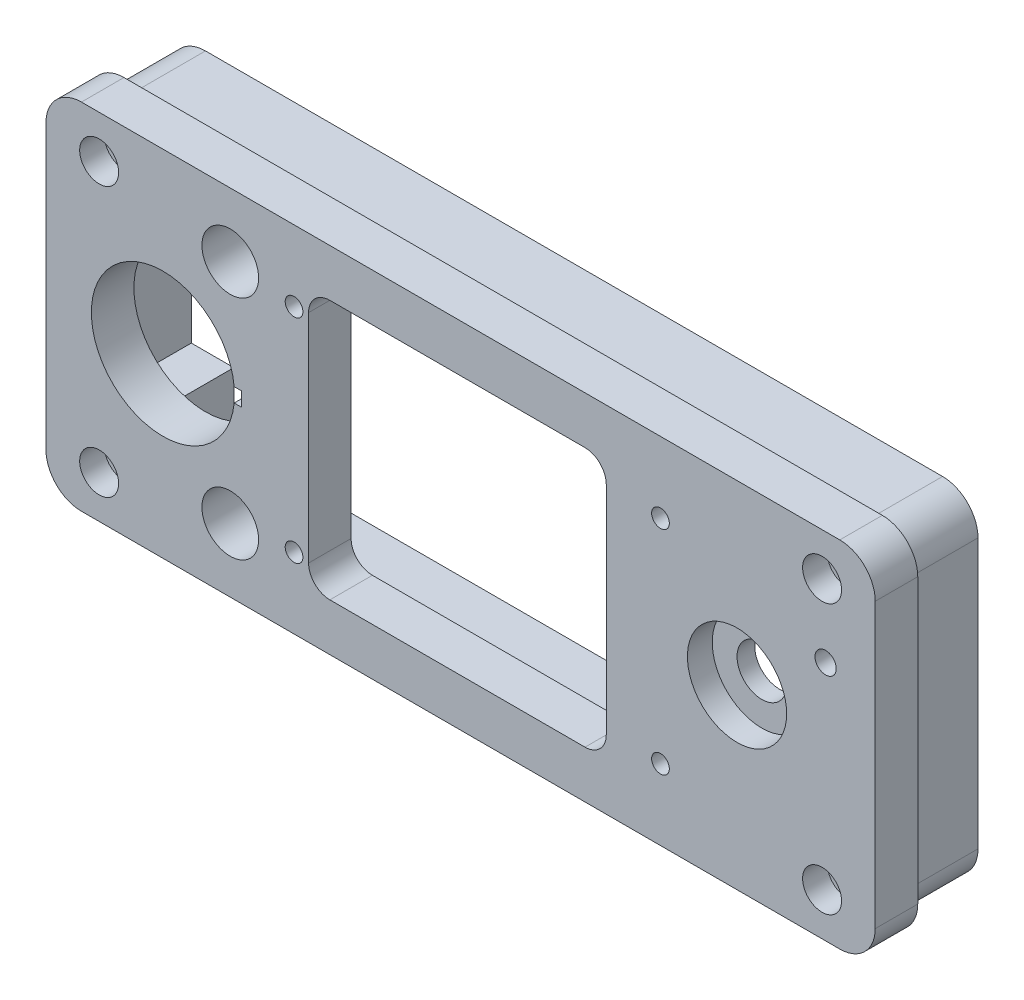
ISO-10303-21;
HEADER;
FILE_DESCRIPTION(('STEP AP214'),'2;1');
FILE_NAME('part.step','',(''),(''),'','','');
FILE_SCHEMA(('AUTOMOTIVE_DESIGN { 1 0 10303 214 1 1 1 1 }'));
ENDSEC;
DATA;
#1=APPLICATION_CONTEXT('core data for automotive mechanical design processes');
#2=APPLICATION_PROTOCOL_DEFINITION('international standard','automotive_design',2000,#1);
#3=PRODUCT_CONTEXT('',#1,'mechanical');
#4=PRODUCT('Part','Part','',(#3));
#5=PRODUCT_RELATED_PRODUCT_CATEGORY('part','',(#4));
#6=PRODUCT_DEFINITION_FORMATION('','',#4);
#7=PRODUCT_DEFINITION_CONTEXT('part definition',#1,'design');
#8=PRODUCT_DEFINITION('design','',#6,#7);
#9=PRODUCT_DEFINITION_SHAPE('','',#8);
#10=(LENGTH_UNIT() NAMED_UNIT(*) SI_UNIT(.MILLI.,.METRE.));
#11=(NAMED_UNIT(*) PLANE_ANGLE_UNIT() SI_UNIT($,.RADIAN.));
#12=(NAMED_UNIT(*) SI_UNIT($,.STERADIAN.) SOLID_ANGLE_UNIT());
#13=UNCERTAINTY_MEASURE_WITH_UNIT(LENGTH_MEASURE(1.E-05),#10,'distance_accuracy_value','');
#14=(GEOMETRIC_REPRESENTATION_CONTEXT(3) GLOBAL_UNCERTAINTY_ASSIGNED_CONTEXT((#13)) GLOBAL_UNIT_ASSIGNED_CONTEXT((#10,
#11,#12)) REPRESENTATION_CONTEXT('',''));
#15=CARTESIAN_POINT('',(0.,0.,0.));
#16=DIRECTION('',(0.,0.,1.));
#17=DIRECTION('',(1.,0.,0.));
#18=AXIS2_PLACEMENT_3D('',#15,#16,#17);
#19=CARTESIAN_POINT('',(110.5,6.,-10.));
#20=DIRECTION('',(0.,0.,1.));
#21=DIRECTION('',(1.,0.,0.));
#22=AXIS2_PLACEMENT_3D('',#19,#20,#21);
#23=PLANE('',#22);
#24=CARTESIAN_POINT('',(110.5,6.,-10.));
#25=DIRECTION('',(0.,0.,-1.));
#26=DIRECTION('',(1.,0.,0.));
#27=AXIS2_PLACEMENT_3D('',#24,#25,#26);
#28=CIRCLE('',#27,5.);
#29=CARTESIAN_POINT('',(115.5,6.00000000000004,-10.));
#30=VERTEX_POINT('',#29);
#31=CARTESIAN_POINT('',(110.5,1.,-10.));
#32=VERTEX_POINT('',#31);
#33=EDGE_CURVE('E273',#30,#32,#28,.T.);
#34=ORIENTED_EDGE('',*,*,#33,.T.);
#35=DIRECTION('',(-1.,0.,0.));
#36=VECTOR('',#35,1.);
#37=CARTESIAN_POINT('',(110.5,1.,-10.));
#38=LINE('',#37,#36);
#39=CARTESIAN_POINT('',(6.5,1.,-10.));
#40=VERTEX_POINT('',#39);
#41=EDGE_CURVE('E276',#32,#40,#38,.T.);
#42=ORIENTED_EDGE('',*,*,#41,.T.);
#43=CARTESIAN_POINT('',(6.49999999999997,6.,-10.));
#44=DIRECTION('',(0.,0.,-1.));
#45=DIRECTION('',(-1.,0.,0.));
#46=AXIS2_PLACEMENT_3D('',#43,#44,#45);
#47=CIRCLE('',#46,5.);
#48=CARTESIAN_POINT('',(1.49999999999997,6.00000000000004,-10.));
#49=VERTEX_POINT('',#48);
#50=EDGE_CURVE('E279',#40,#49,#47,.T.);
#51=ORIENTED_EDGE('',*,*,#50,.T.);
#52=DIRECTION('',(0.,1.,0.));
#53=VECTOR('',#52,1.);
#54=CARTESIAN_POINT('',(1.49999999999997,6.00000000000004,-10.));
#55=LINE('',#54,#53);
#56=CARTESIAN_POINT('',(1.49999999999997,44.,-10.));
#57=VERTEX_POINT('',#56);
#58=EDGE_CURVE('E281',#49,#57,#55,.T.);
#59=ORIENTED_EDGE('',*,*,#58,.T.);
#60=CARTESIAN_POINT('',(6.49999999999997,44.,-10.));
#61=DIRECTION('',(0.,0.,-1.));
#62=DIRECTION('',(-1.,0.,0.));
#63=AXIS2_PLACEMENT_3D('',#60,#61,#62);
#64=CIRCLE('',#63,5.);
#65=CARTESIAN_POINT('',(6.5,49.,-10.));
#66=VERTEX_POINT('',#65);
#67=EDGE_CURVE('E283',#57,#66,#64,.T.);
#68=ORIENTED_EDGE('',*,*,#67,.T.);
#69=DIRECTION('',(1.,0.,0.));
#70=VECTOR('',#69,1.);
#71=CARTESIAN_POINT('',(6.5,49.,-10.));
#72=LINE('',#71,#70);
#73=CARTESIAN_POINT('',(110.5,49.,-10.));
#74=VERTEX_POINT('',#73);
#75=EDGE_CURVE('E285',#66,#74,#72,.T.);
#76=ORIENTED_EDGE('',*,*,#75,.T.);
#77=CARTESIAN_POINT('',(110.5,44.,-10.));
#78=DIRECTION('',(0.,0.,-1.));
#79=DIRECTION('',(-1.,0.,0.));
#80=AXIS2_PLACEMENT_3D('',#77,#78,#79);
#81=CIRCLE('',#80,5.);
#82=CARTESIAN_POINT('',(115.5,44.,-10.));
#83=VERTEX_POINT('',#82);
#84=EDGE_CURVE('E287',#74,#83,#81,.T.);
#85=ORIENTED_EDGE('',*,*,#84,.T.);
#86=DIRECTION('',(0.,-1.,0.));
#87=VECTOR('',#86,1.);
#88=CARTESIAN_POINT('',(115.5,44.,-10.));
#89=LINE('',#88,#87);
#90=EDGE_CURVE('E289',#83,#30,#89,.T.);
#91=ORIENTED_EDGE('',*,*,#90,.T.);
#92=EDGE_LOOP('',(#34,#42,#51,#59,#68,#76,#85,#91));
#93=FACE_BOUND('',#92,.T.);
#94=DIRECTION('',(0.,-1.,0.));
#95=VECTOR('',#94,1.);
#96=CARTESIAN_POINT('',(106.5,47.2,-10.));
#97=LINE('',#96,#95);
#98=CARTESIAN_POINT('',(106.5,47.2,-10.));
#99=VERTEX_POINT('',#98);
#100=CARTESIAN_POINT('',(106.5,37.7,-10.));
#101=VERTEX_POINT('',#100);
#102=EDGE_CURVE('E180',#99,#101,#97,.T.);
#103=ORIENTED_EDGE('',*,*,#102,.F.);
#104=DIRECTION('',(1.,0.,0.));
#105=VECTOR('',#104,1.);
#106=CARTESIAN_POINT('',(106.5,47.2,-10.));
#107=LINE('',#106,#105);
#108=CARTESIAN_POINT('',(10.5,47.2,-10.));
#109=VERTEX_POINT('',#108);
#110=EDGE_CURVE('E221',#109,#99,#107,.T.);
#111=ORIENTED_EDGE('',*,*,#110,.F.);
#112=DIRECTION('',(0.,1.,0.));
#113=VECTOR('',#112,1.);
#114=CARTESIAN_POINT('',(10.5,47.2,-10.));
#115=LINE('',#114,#113);
#116=CARTESIAN_POINT('',(10.5,37.7,-10.));
#117=VERTEX_POINT('',#116);
#118=EDGE_CURVE('E219',#117,#109,#115,.T.);
#119=ORIENTED_EDGE('',*,*,#118,.F.);
#120=DIRECTION('',(1.,0.,0.));
#121=VECTOR('',#120,1.);
#122=CARTESIAN_POINT('',(4.49999999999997,37.7,-10.));
#123=LINE('',#122,#121);
#124=CARTESIAN_POINT('',(4.49999999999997,37.7,-10.));
#125=VERTEX_POINT('',#124);
#126=EDGE_CURVE('E217',#125,#117,#123,.T.);
#127=ORIENTED_EDGE('',*,*,#126,.F.);
#128=DIRECTION('',(0.,1.,0.));
#129=VECTOR('',#128,1.);
#130=CARTESIAN_POINT('',(4.49999999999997,12.3,-10.));
#131=LINE('',#130,#129);
#132=CARTESIAN_POINT('',(4.49999999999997,12.3,-10.));
#133=VERTEX_POINT('',#132);
#134=EDGE_CURVE('E215',#133,#125,#131,.T.);
#135=ORIENTED_EDGE('',*,*,#134,.F.);
#136=DIRECTION('',(-1.,0.,0.));
#137=VECTOR('',#136,1.);
#138=CARTESIAN_POINT('',(10.5,12.3,-10.));
#139=LINE('',#138,#137);
#140=CARTESIAN_POINT('',(10.5,12.3,-10.));
#141=VERTEX_POINT('',#140);
#142=EDGE_CURVE('E213',#141,#133,#139,.T.);
#143=ORIENTED_EDGE('',*,*,#142,.F.);
#144=DIRECTION('',(0.,1.,0.));
#145=VECTOR('',#144,1.);
#146=CARTESIAN_POINT('',(10.5,2.8,-10.));
#147=LINE('',#146,#145);
#148=CARTESIAN_POINT('',(10.5,2.8,-10.));
#149=VERTEX_POINT('',#148);
#150=EDGE_CURVE('E211',#149,#141,#147,.T.);
#151=ORIENTED_EDGE('',*,*,#150,.F.);
#152=DIRECTION('',(-1.,0.,0.));
#153=VECTOR('',#152,1.);
#154=CARTESIAN_POINT('',(106.5,2.8,-10.));
#155=LINE('',#154,#153);
#156=CARTESIAN_POINT('',(106.5,2.8,-10.));
#157=VERTEX_POINT('',#156);
#158=EDGE_CURVE('E209',#157,#149,#155,.T.);
#159=ORIENTED_EDGE('',*,*,#158,.F.);
#160=DIRECTION('',(0.,-1.,0.));
#161=VECTOR('',#160,1.);
#162=CARTESIAN_POINT('',(106.5,2.8,-10.));
#163=LINE('',#162,#161);
#164=CARTESIAN_POINT('',(106.5,12.3,-10.));
#165=VERTEX_POINT('',#164);
#166=EDGE_CURVE('E207',#165,#157,#163,.T.);
#167=ORIENTED_EDGE('',*,*,#166,.F.);
#168=DIRECTION('',(-1.,0.,0.));
#169=VECTOR('',#168,1.);
#170=CARTESIAN_POINT('',(106.5,12.3,-10.));
#171=LINE('',#170,#169);
#172=CARTESIAN_POINT('',(112.5,12.3,-10.));
#173=VERTEX_POINT('',#172);
#174=EDGE_CURVE('E203',#173,#165,#171,.T.);
#175=ORIENTED_EDGE('',*,*,#174,.F.);
#176=DIRECTION('',(0.,-1.,0.));
#177=VECTOR('',#176,1.);
#178=CARTESIAN_POINT('',(112.5,12.3,-10.));
#179=LINE('',#178,#177);
#180=CARTESIAN_POINT('',(112.5,37.7,-10.));
#181=VERTEX_POINT('',#180);
#182=EDGE_CURVE('E201',#181,#173,#179,.T.);
#183=ORIENTED_EDGE('',*,*,#182,.F.);
#184=DIRECTION('',(1.,0.,0.));
#185=VECTOR('',#184,1.);
#186=CARTESIAN_POINT('',(112.5,37.7,-10.));
#187=LINE('',#186,#185);
#188=EDGE_CURVE('E188',#101,#181,#187,.T.);
#189=ORIENTED_EDGE('',*,*,#188,.F.);
#190=EDGE_LOOP('',(#103,#111,#119,#127,#135,#143,#151,#159,#167,#175,#183,#189));
#191=FACE_BOUND('',#190,.T.);
#192=ADVANCED_FACE('F43',(#93,#191),#23,.F.);
#193=CARTESIAN_POINT('',(110.5,6.,0.));
#194=DIRECTION('',(0.,0.,1.));
#195=DIRECTION('',(1.,0.,0.));
#196=AXIS2_PLACEMENT_3D('',#193,#194,#195);
#197=PLANE('',#196);
#198=CARTESIAN_POINT('',(110.5,6.,0.));
#199=DIRECTION('',(0.,0.,-1.));
#200=DIRECTION('',(1.,0.,0.));
#201=AXIS2_PLACEMENT_3D('',#198,#199,#200);
#202=CIRCLE('',#201,5.);
#203=CARTESIAN_POINT('',(115.5,6.00000000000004,0.));
#204=VERTEX_POINT('',#203);
#205=CARTESIAN_POINT('',(110.5,1.,0.));
#206=VERTEX_POINT('',#205);
#207=EDGE_CURVE('E196',#204,#206,#202,.T.);
#208=ORIENTED_EDGE('',*,*,#207,.F.);
#209=DIRECTION('',(0.,-1.,0.));
#210=VECTOR('',#209,1.);
#211=CARTESIAN_POINT('',(115.5,44.,0.));
#212=LINE('',#211,#210);
#213=CARTESIAN_POINT('',(115.5,44.,0.));
#214=VERTEX_POINT('',#213);
#215=EDGE_CURVE('E277',#214,#204,#212,.T.);
#216=ORIENTED_EDGE('',*,*,#215,.F.);
#217=CARTESIAN_POINT('',(110.5,44.,0.));
#218=DIRECTION('',(0.,0.,-1.));
#219=DIRECTION('',(-1.,0.,0.));
#220=AXIS2_PLACEMENT_3D('',#217,#218,#219);
#221=CIRCLE('',#220,5.);
#222=CARTESIAN_POINT('',(110.5,49.,0.));
#223=VERTEX_POINT('',#222);
#224=EDGE_CURVE('E304',#223,#214,#221,.T.);
#225=ORIENTED_EDGE('',*,*,#224,.F.);
#226=DIRECTION('',(1.,0.,0.));
#227=VECTOR('',#226,1.);
#228=CARTESIAN_POINT('',(6.5,49.,0.));
#229=LINE('',#228,#227);
#230=CARTESIAN_POINT('',(6.5,49.,0.));
#231=VERTEX_POINT('',#230);
#232=EDGE_CURVE('E302',#231,#223,#229,.T.);
#233=ORIENTED_EDGE('',*,*,#232,.F.);
#234=CARTESIAN_POINT('',(6.49999999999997,44.,0.));
#235=DIRECTION('',(0.,0.,-1.));
#236=DIRECTION('',(-1.,0.,0.));
#237=AXIS2_PLACEMENT_3D('',#234,#235,#236);
#238=CIRCLE('',#237,5.);
#239=CARTESIAN_POINT('',(1.49999999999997,44.,0.));
#240=VERTEX_POINT('',#239);
#241=EDGE_CURVE('E300',#240,#231,#238,.T.);
#242=ORIENTED_EDGE('',*,*,#241,.F.);
#243=DIRECTION('',(0.,1.,0.));
#244=VECTOR('',#243,1.);
#245=CARTESIAN_POINT('',(1.49999999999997,6.00000000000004,0.));
#246=LINE('',#245,#244);
#247=CARTESIAN_POINT('',(1.49999999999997,6.00000000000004,0.));
#248=VERTEX_POINT('',#247);
#249=EDGE_CURVE('E298',#248,#240,#246,.T.);
#250=ORIENTED_EDGE('',*,*,#249,.F.);
#251=CARTESIAN_POINT('',(6.49999999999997,6.,0.));
#252=DIRECTION('',(0.,0.,-1.));
#253=DIRECTION('',(-1.,0.,0.));
#254=AXIS2_PLACEMENT_3D('',#251,#252,#253);
#255=CIRCLE('',#254,5.);
#256=CARTESIAN_POINT('',(6.5,1.,0.));
#257=VERTEX_POINT('',#256);
#258=EDGE_CURVE('E296',#257,#248,#255,.T.);
#259=ORIENTED_EDGE('',*,*,#258,.F.);
#260=DIRECTION('',(-1.,0.,0.));
#261=VECTOR('',#260,1.);
#262=CARTESIAN_POINT('',(110.5,1.,0.));
#263=LINE('',#262,#261);
#264=EDGE_CURVE('E294',#206,#257,#263,.T.);
#265=ORIENTED_EDGE('',*,*,#264,.F.);
#266=EDGE_LOOP('',(#208,#216,#225,#233,#242,#250,#259,#265));
#267=FACE_BOUND('',#266,.T.);
#268=DIRECTION('',(1.,0.,0.));
#269=VECTOR('',#268,1.);
#270=CARTESIAN_POINT('',(106.5,47.2,0.));
#271=LINE('',#270,#269);
#272=CARTESIAN_POINT('',(10.5,47.2,0.));
#273=VERTEX_POINT('',#272);
#274=CARTESIAN_POINT('',(106.5,47.2,0.));
#275=VERTEX_POINT('',#274);
#276=EDGE_CURVE('E189',#273,#275,#271,.T.);
#277=ORIENTED_EDGE('',*,*,#276,.T.);
#278=DIRECTION('',(0.,-1.,0.));
#279=VECTOR('',#278,1.);
#280=CARTESIAN_POINT('',(106.5,47.2,0.));
#281=LINE('',#280,#279);
#282=CARTESIAN_POINT('',(106.5,37.7,0.));
#283=VERTEX_POINT('',#282);
#284=EDGE_CURVE('E66',#275,#283,#281,.T.);
#285=ORIENTED_EDGE('',*,*,#284,.T.);
#286=DIRECTION('',(1.,0.,0.));
#287=VECTOR('',#286,1.);
#288=CARTESIAN_POINT('',(112.5,37.7,0.));
#289=LINE('',#288,#287);
#290=CARTESIAN_POINT('',(112.5,37.7,0.));
#291=VERTEX_POINT('',#290);
#292=EDGE_CURVE('E195',#283,#291,#289,.T.);
#293=ORIENTED_EDGE('',*,*,#292,.T.);
#294=DIRECTION('',(0.,-1.,0.));
#295=VECTOR('',#294,1.);
#296=CARTESIAN_POINT('',(112.5,12.3,0.));
#297=LINE('',#296,#295);
#298=CARTESIAN_POINT('',(112.5,12.3,0.));
#299=VERTEX_POINT('',#298);
#300=EDGE_CURVE('E225',#291,#299,#297,.T.);
#301=ORIENTED_EDGE('',*,*,#300,.T.);
#302=DIRECTION('',(-1.,0.,0.));
#303=VECTOR('',#302,1.);
#304=CARTESIAN_POINT('',(106.5,12.3,0.));
#305=LINE('',#304,#303);
#306=CARTESIAN_POINT('',(106.5,12.3,0.));
#307=VERTEX_POINT('',#306);
#308=EDGE_CURVE('E228',#299,#307,#305,.T.);
#309=ORIENTED_EDGE('',*,*,#308,.T.);
#310=DIRECTION('',(0.,-1.,0.));
#311=VECTOR('',#310,1.);
#312=CARTESIAN_POINT('',(106.5,2.8,0.));
#313=LINE('',#312,#311);
#314=CARTESIAN_POINT('',(106.5,2.8,0.));
#315=VERTEX_POINT('',#314);
#316=EDGE_CURVE('E231',#307,#315,#313,.T.);
#317=ORIENTED_EDGE('',*,*,#316,.T.);
#318=DIRECTION('',(-1.,0.,0.));
#319=VECTOR('',#318,1.);
#320=CARTESIAN_POINT('',(106.5,2.8,0.));
#321=LINE('',#320,#319);
#322=CARTESIAN_POINT('',(10.5,2.8,0.));
#323=VERTEX_POINT('',#322);
#324=EDGE_CURVE('E234',#315,#323,#321,.T.);
#325=ORIENTED_EDGE('',*,*,#324,.T.);
#326=DIRECTION('',(0.,1.,0.));
#327=VECTOR('',#326,1.);
#328=CARTESIAN_POINT('',(10.5,2.8,0.));
#329=LINE('',#328,#327);
#330=CARTESIAN_POINT('',(10.5,12.3,0.));
#331=VERTEX_POINT('',#330);
#332=EDGE_CURVE('E237',#323,#331,#329,.T.);
#333=ORIENTED_EDGE('',*,*,#332,.T.);
#334=DIRECTION('',(-1.,0.,0.));
#335=VECTOR('',#334,1.);
#336=CARTESIAN_POINT('',(10.5,12.3,0.));
#337=LINE('',#336,#335);
#338=CARTESIAN_POINT('',(4.49999999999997,12.3,0.));
#339=VERTEX_POINT('',#338);
#340=EDGE_CURVE('E240',#331,#339,#337,.T.);
#341=ORIENTED_EDGE('',*,*,#340,.T.);
#342=DIRECTION('',(0.,1.,0.));
#343=VECTOR('',#342,1.);
#344=CARTESIAN_POINT('',(4.49999999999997,12.3,0.));
#345=LINE('',#344,#343);
#346=CARTESIAN_POINT('',(4.49999999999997,37.7,0.));
#347=VERTEX_POINT('',#346);
#348=EDGE_CURVE('E243',#339,#347,#345,.T.);
#349=ORIENTED_EDGE('',*,*,#348,.T.);
#350=DIRECTION('',(1.,0.,0.));
#351=VECTOR('',#350,1.);
#352=CARTESIAN_POINT('',(4.49999999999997,37.7,0.));
#353=LINE('',#352,#351);
#354=CARTESIAN_POINT('',(10.5,37.7,0.));
#355=VERTEX_POINT('',#354);
#356=EDGE_CURVE('E246',#347,#355,#353,.T.);
#357=ORIENTED_EDGE('',*,*,#356,.T.);
#358=DIRECTION('',(0.,1.,0.));
#359=VECTOR('',#358,1.);
#360=CARTESIAN_POINT('',(10.5,47.2,0.));
#361=LINE('',#360,#359);
#362=EDGE_CURVE('E249',#355,#273,#361,.T.);
#363=ORIENTED_EDGE('',*,*,#362,.T.);
#364=EDGE_LOOP('',(#277,#285,#293,#301,#309,#317,#325,#333,#341,#349,#357,#363));
#365=FACE_BOUND('',#364,.T.);
#366=ADVANCED_FACE('F334',(#267,#365),#197,.T.);
#367=CARTESIAN_POINT('',(110.5,6.,-10.));
#368=DIRECTION('',(0.,0.,1.));
#369=DIRECTION('',(1.,0.,0.));
#370=AXIS2_PLACEMENT_3D('',#367,#368,#369);
#371=CYLINDRICAL_SURFACE('',#370,5.);
#372=ORIENTED_EDGE('',*,*,#207,.T.);
#373=DIRECTION('',(0.,0.,1.));
#374=VECTOR('',#373,1.);
#375=CARTESIAN_POINT('',(110.5,1.,-10.));
#376=LINE('',#375,#374);
#377=EDGE_CURVE('E12',#32,#206,#376,.T.);
#378=ORIENTED_EDGE('',*,*,#377,.F.);
#379=ORIENTED_EDGE('',*,*,#33,.F.);
#380=DIRECTION('',(0.,0.,1.));
#381=VECTOR('',#380,1.);
#382=CARTESIAN_POINT('',(115.5,6.00000000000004,-10.));
#383=LINE('',#382,#381);
#384=EDGE_CURVE('E291',#30,#204,#383,.T.);
#385=ORIENTED_EDGE('',*,*,#384,.T.);
#386=EDGE_LOOP('',(#372,#378,#379,#385));
#387=FACE_BOUND('',#386,.T.);
#388=ADVANCED_FACE('F45',(#387),#371,.T.);
#389=CARTESIAN_POINT('',(110.5,1.,-10.));
#390=DIRECTION('',(0.,1.,0.));
#391=DIRECTION('',(-1.,0.,0.));
#392=AXIS2_PLACEMENT_3D('',#389,#390,#391);
#393=PLANE('',#392);
#394=ORIENTED_EDGE('',*,*,#264,.T.);
#395=DIRECTION('',(0.,0.,1.));
#396=VECTOR('',#395,1.);
#397=CARTESIAN_POINT('',(6.5,1.,-10.));
#398=LINE('',#397,#396);
#399=EDGE_CURVE('E51',#40,#257,#398,.T.);
#400=ORIENTED_EDGE('',*,*,#399,.F.);
#401=ORIENTED_EDGE('',*,*,#41,.F.);
#402=ORIENTED_EDGE('',*,*,#377,.T.);
#403=EDGE_LOOP('',(#394,#400,#401,#402));
#404=FACE_BOUND('',#403,.T.);
#405=ADVANCED_FACE('F351',(#404),#393,.F.);
#406=CARTESIAN_POINT('',(6.49999999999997,6.,-10.));
#407=DIRECTION('',(0.,0.,1.));
#408=DIRECTION('',(1.,0.,0.));
#409=AXIS2_PLACEMENT_3D('',#406,#407,#408);
#410=CYLINDRICAL_SURFACE('',#409,5.);
#411=ORIENTED_EDGE('',*,*,#258,.T.);
#412=DIRECTION('',(0.,0.,1.));
#413=VECTOR('',#412,1.);
#414=CARTESIAN_POINT('',(1.49999999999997,6.00000000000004,-10.));
#415=LINE('',#414,#413);
#416=EDGE_CURVE('E321',#49,#248,#415,.T.);
#417=ORIENTED_EDGE('',*,*,#416,.F.);
#418=ORIENTED_EDGE('',*,*,#50,.F.);
#419=ORIENTED_EDGE('',*,*,#399,.T.);
#420=EDGE_LOOP('',(#411,#417,#418,#419));
#421=FACE_BOUND('',#420,.T.);
#422=ADVANCED_FACE('F328',(#421),#410,.T.);
#423=CARTESIAN_POINT('',(1.49999999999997,6.00000000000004,-10.));
#424=DIRECTION('',(1.,0.,0.));
#425=DIRECTION('',(0.,0.,-1.));
#426=AXIS2_PLACEMENT_3D('',#423,#424,#425);
#427=PLANE('',#426);
#428=ORIENTED_EDGE('',*,*,#249,.T.);
#429=DIRECTION('',(0.,0.,1.));
#430=VECTOR('',#429,1.);
#431=CARTESIAN_POINT('',(1.49999999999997,44.,-10.));
#432=LINE('',#431,#430);
#433=EDGE_CURVE('E318',#57,#240,#432,.T.);
#434=ORIENTED_EDGE('',*,*,#433,.F.);
#435=ORIENTED_EDGE('',*,*,#58,.F.);
#436=ORIENTED_EDGE('',*,*,#416,.T.);
#437=EDGE_LOOP('',(#428,#434,#435,#436));
#438=FACE_BOUND('',#437,.T.);
#439=ADVANCED_FACE('F340',(#438),#427,.F.);
#440=CARTESIAN_POINT('',(6.49999999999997,44.,-10.));
#441=DIRECTION('',(0.,0.,1.));
#442=DIRECTION('',(1.,0.,0.));
#443=AXIS2_PLACEMENT_3D('',#440,#441,#442);
#444=CYLINDRICAL_SURFACE('',#443,5.);
#445=ORIENTED_EDGE('',*,*,#241,.T.);
#446=DIRECTION('',(0.,0.,1.));
#447=VECTOR('',#446,1.);
#448=CARTESIAN_POINT('',(6.5,49.,-10.));
#449=LINE('',#448,#447);
#450=EDGE_CURVE('E315',#66,#231,#449,.T.);
#451=ORIENTED_EDGE('',*,*,#450,.F.);
#452=ORIENTED_EDGE('',*,*,#67,.F.);
#453=ORIENTED_EDGE('',*,*,#433,.T.);
#454=EDGE_LOOP('',(#445,#451,#452,#453));
#455=FACE_BOUND('',#454,.T.);
#456=ADVANCED_FACE('F344',(#455),#444,.T.);
#457=CARTESIAN_POINT('',(6.5,49.,-10.));
#458=DIRECTION('',(0.,-1.,0.));
#459=DIRECTION('',(1.,0.,0.));
#460=AXIS2_PLACEMENT_3D('',#457,#458,#459);
#461=PLANE('',#460);
#462=ORIENTED_EDGE('',*,*,#232,.T.);
#463=DIRECTION('',(0.,0.,1.));
#464=VECTOR('',#463,1.);
#465=CARTESIAN_POINT('',(110.5,49.,-10.));
#466=LINE('',#465,#464);
#467=EDGE_CURVE('E312',#74,#223,#466,.T.);
#468=ORIENTED_EDGE('',*,*,#467,.F.);
#469=ORIENTED_EDGE('',*,*,#75,.F.);
#470=ORIENTED_EDGE('',*,*,#450,.T.);
#471=EDGE_LOOP('',(#462,#468,#469,#470));
#472=FACE_BOUND('',#471,.T.);
#473=ADVANCED_FACE('F364',(#472),#461,.F.);
#474=CARTESIAN_POINT('',(110.5,44.,-10.));
#475=DIRECTION('',(0.,0.,1.));
#476=DIRECTION('',(1.,0.,0.));
#477=AXIS2_PLACEMENT_3D('',#474,#475,#476);
#478=CYLINDRICAL_SURFACE('',#477,5.);
#479=ORIENTED_EDGE('',*,*,#224,.T.);
#480=DIRECTION('',(0.,0.,1.));
#481=VECTOR('',#480,1.);
#482=CARTESIAN_POINT('',(115.5,44.,-10.));
#483=LINE('',#482,#481);
#484=EDGE_CURVE('E309',#83,#214,#483,.T.);
#485=ORIENTED_EDGE('',*,*,#484,.F.);
#486=ORIENTED_EDGE('',*,*,#84,.F.);
#487=ORIENTED_EDGE('',*,*,#467,.T.);
#488=EDGE_LOOP('',(#479,#485,#486,#487));
#489=FACE_BOUND('',#488,.T.);
#490=ADVANCED_FACE('F362',(#489),#478,.T.);
#491=CARTESIAN_POINT('',(115.5,44.,-10.));
#492=DIRECTION('',(-1.,0.,0.));
#493=DIRECTION('',(0.,0.,1.));
#494=AXIS2_PLACEMENT_3D('',#491,#492,#493);
#495=PLANE('',#494);
#496=ORIENTED_EDGE('',*,*,#215,.T.);
#497=ORIENTED_EDGE('',*,*,#384,.F.);
#498=ORIENTED_EDGE('',*,*,#90,.F.);
#499=ORIENTED_EDGE('',*,*,#484,.T.);
#500=EDGE_LOOP('',(#496,#497,#498,#499));
#501=FACE_BOUND('',#500,.T.);
#502=ADVANCED_FACE('F357',(#501),#495,.F.);
#503=CARTESIAN_POINT('',(106.5,47.2,-10.));
#504=DIRECTION('',(-1.,0.,0.));
#505=DIRECTION('',(0.,0.,1.));
#506=AXIS2_PLACEMENT_3D('',#503,#504,#505);
#507=PLANE('',#506);
#508=ORIENTED_EDGE('',*,*,#284,.F.);
#509=DIRECTION('',(0.,0.,1.));
#510=VECTOR('',#509,1.);
#511=CARTESIAN_POINT('',(106.5,47.2,-10.));
#512=LINE('',#511,#510);
#513=EDGE_CURVE('E184',#99,#275,#512,.T.);
#514=ORIENTED_EDGE('',*,*,#513,.F.);
#515=ORIENTED_EDGE('',*,*,#102,.T.);
#516=DIRECTION('',(0.,0.,1.));
#517=VECTOR('',#516,1.);
#518=CARTESIAN_POINT('',(106.5,37.7,-10.));
#519=LINE('',#518,#517);
#520=EDGE_CURVE('E183',#101,#283,#519,.T.);
#521=ORIENTED_EDGE('',*,*,#520,.T.);
#522=EDGE_LOOP('',(#508,#514,#515,#521));
#523=FACE_BOUND('',#522,.T.);
#524=ADVANCED_FACE('F182',(#523),#507,.T.);
#525=CARTESIAN_POINT('',(112.5,37.7,-10.));
#526=DIRECTION('',(0.,-1.,0.));
#527=DIRECTION('',(0.,0.,-1.));
#528=AXIS2_PLACEMENT_3D('',#525,#526,#527);
#529=PLANE('',#528);
#530=ORIENTED_EDGE('',*,*,#292,.F.);
#531=ORIENTED_EDGE('',*,*,#520,.F.);
#532=ORIENTED_EDGE('',*,*,#188,.T.);
#533=DIRECTION('',(0.,0.,1.));
#534=VECTOR('',#533,1.);
#535=CARTESIAN_POINT('',(112.5,37.7,-10.));
#536=LINE('',#535,#534);
#537=EDGE_CURVE('E197',#181,#291,#536,.T.);
#538=ORIENTED_EDGE('',*,*,#537,.T.);
#539=EDGE_LOOP('',(#530,#531,#532,#538));
#540=FACE_BOUND('',#539,.T.);
#541=ADVANCED_FACE('F192',(#540),#529,.T.);
#542=CARTESIAN_POINT('',(112.5,12.3,-10.));
#543=DIRECTION('',(-1.,0.,0.));
#544=DIRECTION('',(0.,0.,1.));
#545=AXIS2_PLACEMENT_3D('',#542,#543,#544);
#546=PLANE('',#545);
#547=ORIENTED_EDGE('',*,*,#300,.F.);
#548=ORIENTED_EDGE('',*,*,#537,.F.);
#549=ORIENTED_EDGE('',*,*,#182,.T.);
#550=DIRECTION('',(0.,0.,1.));
#551=VECTOR('',#550,1.);
#552=CARTESIAN_POINT('',(112.5,12.3,-10.));
#553=LINE('',#552,#551);
#554=EDGE_CURVE('E270',#173,#299,#553,.T.);
#555=ORIENTED_EDGE('',*,*,#554,.T.);
#556=EDGE_LOOP('',(#547,#548,#549,#555));
#557=FACE_BOUND('',#556,.T.);
#558=ADVANCED_FACE('F389',(#557),#546,.T.);
#559=CARTESIAN_POINT('',(106.5,12.3,-10.));
#560=DIRECTION('',(0.,1.,0.));
#561=DIRECTION('',(0.,0.,1.));
#562=AXIS2_PLACEMENT_3D('',#559,#560,#561);
#563=PLANE('',#562);
#564=ORIENTED_EDGE('',*,*,#308,.F.);
#565=ORIENTED_EDGE('',*,*,#554,.F.);
#566=ORIENTED_EDGE('',*,*,#174,.T.);
#567=DIRECTION('',(0.,0.,1.));
#568=VECTOR('',#567,1.);
#569=CARTESIAN_POINT('',(106.5,12.3,-10.));
#570=LINE('',#569,#568);
#571=EDGE_CURVE('E268',#165,#307,#570,.T.);
#572=ORIENTED_EDGE('',*,*,#571,.T.);
#573=EDGE_LOOP('',(#564,#565,#566,#572));
#574=FACE_BOUND('',#573,.T.);
#575=ADVANCED_FACE('F393',(#574),#563,.T.);
#576=CARTESIAN_POINT('',(106.5,2.8,-10.));
#577=DIRECTION('',(-1.,0.,0.));
#578=DIRECTION('',(0.,0.,1.));
#579=AXIS2_PLACEMENT_3D('',#576,#577,#578);
#580=PLANE('',#579);
#581=ORIENTED_EDGE('',*,*,#316,.F.);
#582=ORIENTED_EDGE('',*,*,#571,.F.);
#583=ORIENTED_EDGE('',*,*,#166,.T.);
#584=DIRECTION('',(0.,0.,1.));
#585=VECTOR('',#584,1.);
#586=CARTESIAN_POINT('',(106.5,2.8,-10.));
#587=LINE('',#586,#585);
#588=EDGE_CURVE('E266',#157,#315,#587,.T.);
#589=ORIENTED_EDGE('',*,*,#588,.T.);
#590=EDGE_LOOP('',(#581,#582,#583,#589));
#591=FACE_BOUND('',#590,.T.);
#592=ADVANCED_FACE('F399',(#591),#580,.T.);
#593=CARTESIAN_POINT('',(106.5,2.8,-10.));
#594=DIRECTION('',(0.,1.,0.));
#595=DIRECTION('',(-1.,0.,0.));
#596=AXIS2_PLACEMENT_3D('',#593,#594,#595);
#597=PLANE('',#596);
#598=ORIENTED_EDGE('',*,*,#324,.F.);
#599=ORIENTED_EDGE('',*,*,#588,.F.);
#600=ORIENTED_EDGE('',*,*,#158,.T.);
#601=DIRECTION('',(0.,0.,1.));
#602=VECTOR('',#601,1.);
#603=CARTESIAN_POINT('',(10.5,2.8,-10.));
#604=LINE('',#603,#602);
#605=EDGE_CURVE('E264',#149,#323,#604,.T.);
#606=ORIENTED_EDGE('',*,*,#605,.T.);
#607=EDGE_LOOP('',(#598,#599,#600,#606));
#608=FACE_BOUND('',#607,.T.);
#609=ADVANCED_FACE('F403',(#608),#597,.T.);
#610=CARTESIAN_POINT('',(10.5,2.8,-10.));
#611=DIRECTION('',(1.,0.,0.));
#612=DIRECTION('',(0.,0.,-1.));
#613=AXIS2_PLACEMENT_3D('',#610,#611,#612);
#614=PLANE('',#613);
#615=ORIENTED_EDGE('',*,*,#332,.F.);
#616=ORIENTED_EDGE('',*,*,#605,.F.);
#617=ORIENTED_EDGE('',*,*,#150,.T.);
#618=DIRECTION('',(0.,0.,1.));
#619=VECTOR('',#618,1.);
#620=CARTESIAN_POINT('',(10.5,12.3,-10.));
#621=LINE('',#620,#619);
#622=EDGE_CURVE('E262',#141,#331,#621,.T.);
#623=ORIENTED_EDGE('',*,*,#622,.T.);
#624=EDGE_LOOP('',(#615,#616,#617,#623));
#625=FACE_BOUND('',#624,.T.);
#626=ADVANCED_FACE('F407',(#625),#614,.T.);
#627=CARTESIAN_POINT('',(10.5,12.3,-10.));
#628=DIRECTION('',(0.,1.,0.));
#629=DIRECTION('',(0.,0.,1.));
#630=AXIS2_PLACEMENT_3D('',#627,#628,#629);
#631=PLANE('',#630);
#632=ORIENTED_EDGE('',*,*,#340,.F.);
#633=ORIENTED_EDGE('',*,*,#622,.F.);
#634=ORIENTED_EDGE('',*,*,#142,.T.);
#635=DIRECTION('',(0.,0.,1.));
#636=VECTOR('',#635,1.);
#637=CARTESIAN_POINT('',(4.49999999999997,12.3,-10.));
#638=LINE('',#637,#636);
#639=EDGE_CURVE('E260',#133,#339,#638,.T.);
#640=ORIENTED_EDGE('',*,*,#639,.T.);
#641=EDGE_LOOP('',(#632,#633,#634,#640));
#642=FACE_BOUND('',#641,.T.);
#643=ADVANCED_FACE('F411',(#642),#631,.T.);
#644=CARTESIAN_POINT('',(4.49999999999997,12.3,-10.));
#645=DIRECTION('',(1.,0.,0.));
#646=DIRECTION('',(0.,0.,-1.));
#647=AXIS2_PLACEMENT_3D('',#644,#645,#646);
#648=PLANE('',#647);
#649=ORIENTED_EDGE('',*,*,#348,.F.);
#650=ORIENTED_EDGE('',*,*,#639,.F.);
#651=ORIENTED_EDGE('',*,*,#134,.T.);
#652=DIRECTION('',(0.,0.,1.));
#653=VECTOR('',#652,1.);
#654=CARTESIAN_POINT('',(4.49999999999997,37.7,-10.));
#655=LINE('',#654,#653);
#656=EDGE_CURVE('E258',#125,#347,#655,.T.);
#657=ORIENTED_EDGE('',*,*,#656,.T.);
#658=EDGE_LOOP('',(#649,#650,#651,#657));
#659=FACE_BOUND('',#658,.T.);
#660=ADVANCED_FACE('F415',(#659),#648,.T.);
#661=CARTESIAN_POINT('',(4.49999999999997,37.7,-10.));
#662=DIRECTION('',(0.,-1.,0.));
#663=DIRECTION('',(0.,0.,-1.));
#664=AXIS2_PLACEMENT_3D('',#661,#662,#663);
#665=PLANE('',#664);
#666=ORIENTED_EDGE('',*,*,#356,.F.);
#667=ORIENTED_EDGE('',*,*,#656,.F.);
#668=ORIENTED_EDGE('',*,*,#126,.T.);
#669=DIRECTION('',(0.,0.,1.));
#670=VECTOR('',#669,1.);
#671=CARTESIAN_POINT('',(10.5,37.7,-10.));
#672=LINE('',#671,#670);
#673=EDGE_CURVE('E256',#117,#355,#672,.T.);
#674=ORIENTED_EDGE('',*,*,#673,.T.);
#675=EDGE_LOOP('',(#666,#667,#668,#674));
#676=FACE_BOUND('',#675,.T.);
#677=ADVANCED_FACE('F419',(#676),#665,.T.);
#678=CARTESIAN_POINT('',(10.5,47.2,-10.));
#679=DIRECTION('',(1.,0.,0.));
#680=DIRECTION('',(0.,1.,0.));
#681=AXIS2_PLACEMENT_3D('',#678,#679,#680);
#682=PLANE('',#681);
#683=ORIENTED_EDGE('',*,*,#362,.F.);
#684=ORIENTED_EDGE('',*,*,#673,.F.);
#685=ORIENTED_EDGE('',*,*,#118,.T.);
#686=DIRECTION('',(0.,0.,1.));
#687=VECTOR('',#686,1.);
#688=CARTESIAN_POINT('',(10.5,47.2,-10.));
#689=LINE('',#688,#687);
#690=EDGE_CURVE('E58',#109,#273,#689,.T.);
#691=ORIENTED_EDGE('',*,*,#690,.T.);
#692=EDGE_LOOP('',(#683,#684,#685,#691));
#693=FACE_BOUND('',#692,.T.);
#694=ADVANCED_FACE('F423',(#693),#682,.T.);
#695=CARTESIAN_POINT('',(106.5,47.2,-10.));
#696=DIRECTION('',(0.,-1.,0.));
#697=DIRECTION('',(0.,0.,-1.));
#698=AXIS2_PLACEMENT_3D('',#695,#696,#697);
#699=PLANE('',#698);
#700=ORIENTED_EDGE('',*,*,#276,.F.);
#701=ORIENTED_EDGE('',*,*,#690,.F.);
#702=ORIENTED_EDGE('',*,*,#110,.T.);
#703=ORIENTED_EDGE('',*,*,#513,.T.);
#704=EDGE_LOOP('',(#700,#701,#702,#703));
#705=FACE_BOUND('',#704,.T.);
#706=ADVANCED_FACE('F427',(#705),#699,.T.);
#707=CLOSED_SHELL('',(#192,#366,#388,#405,#422,#439,#456,#473,#490,#502,#524,#541,#558,#575,
#592,#609,#626,#643,#660,#677,#694,#706));
#708=MANIFOLD_SOLID_BREP('B2',#707);
#709=CARTESIAN_POINT('',(97.500085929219,24.999938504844,6.));
#710=DIRECTION('',(0.,0.,-1.));
#711=DIRECTION('',(-1.,0.,0.));
#712=AXIS2_PLACEMENT_3D('',#709,#710,#711);
#713=CYLINDRICAL_SURFACE('',#712,3.50000000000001);
#714=CARTESIAN_POINT('',(97.500085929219,24.999938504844,0.));
#715=DIRECTION('',(0.,0.,1.));
#716=DIRECTION('',(1.,0.,0.));
#717=AXIS2_PLACEMENT_3D('',#714,#715,#716);
#718=CIRCLE('',#717,3.50000000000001);
#719=CARTESIAN_POINT('',(101.000085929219,24.999938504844,0.));
#720=VERTEX_POINT('',#719);
#721=EDGE_CURVE('E850',#720,#720,#718,.T.);
#722=ORIENTED_EDGE('',*,*,#721,.F.);
#723=EDGE_LOOP('',(#722));
#724=FACE_BOUND('',#723,.T.);
#725=CARTESIAN_POINT('',(97.500085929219,24.999938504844,2.5));
#726=DIRECTION('',(0.,0.,1.));
#727=DIRECTION('',(1.,0.,0.));
#728=AXIS2_PLACEMENT_3D('',#725,#726,#727);
#729=CIRCLE('',#728,3.50000000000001);
#730=CARTESIAN_POINT('',(101.000085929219,24.999938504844,2.5));
#731=VERTEX_POINT('',#730);
#732=EDGE_CURVE('E589',#731,#731,#729,.T.);
#733=ORIENTED_EDGE('',*,*,#732,.T.);
#734=EDGE_LOOP('',(#733));
#735=FACE_BOUND('',#734,.T.);
#736=ADVANCED_FACE('F585',(#724,#735),#713,.F.);
#737=CARTESIAN_POINT('',(109.5,6.00000000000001,6.));
#738=DIRECTION('',(0.,0.,-1.));
#739=DIRECTION('',(-1.,0.,0.));
#740=AXIS2_PLACEMENT_3D('',#737,#738,#739);
#741=CYLINDRICAL_SURFACE('',#740,1.75);
#742=CARTESIAN_POINT('',(109.5,6.00000000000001,0.));
#743=DIRECTION('',(0.,0.,1.));
#744=DIRECTION('',(1.,0.,0.));
#745=AXIS2_PLACEMENT_3D('',#742,#743,#744);
#746=CIRCLE('',#745,1.75);
#747=CARTESIAN_POINT('',(111.25,6.00000000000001,0.));
#748=VERTEX_POINT('',#747);
#749=EDGE_CURVE('E858',#748,#748,#746,.T.);
#750=ORIENTED_EDGE('',*,*,#749,.F.);
#751=EDGE_LOOP('',(#750));
#752=FACE_BOUND('',#751,.T.);
#753=CARTESIAN_POINT('',(109.5,6.00000000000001,2.5));
#754=DIRECTION('',(0.,0.,1.));
#755=DIRECTION('',(1.,0.,0.));
#756=AXIS2_PLACEMENT_3D('',#753,#754,#755);
#757=CIRCLE('',#756,1.75);
#758=CARTESIAN_POINT('',(111.25,6.00000000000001,2.5));
#759=VERTEX_POINT('',#758);
#760=EDGE_CURVE('E935',#759,#759,#757,.T.);
#761=ORIENTED_EDGE('',*,*,#760,.T.);
#762=EDGE_LOOP('',(#761));
#763=FACE_BOUND('',#762,.T.);
#764=ADVANCED_FACE('F993',(#752,#763),#741,.F.);
#765=CARTESIAN_POINT('',(109.5,44.,6.));
#766=DIRECTION('',(0.,0.,-1.));
#767=DIRECTION('',(-1.,0.,0.));
#768=AXIS2_PLACEMENT_3D('',#765,#766,#767);
#769=CYLINDRICAL_SURFACE('',#768,1.75);
#770=CARTESIAN_POINT('',(109.5,44.,0.));
#771=DIRECTION('',(0.,0.,1.));
#772=DIRECTION('',(-1.,0.,0.));
#773=AXIS2_PLACEMENT_3D('',#770,#771,#772);
#774=CIRCLE('',#773,1.75);
#775=CARTESIAN_POINT('',(107.75,44.,0.));
#776=VERTEX_POINT('',#775);
#777=EDGE_CURVE('E864',#776,#776,#774,.T.);
#778=ORIENTED_EDGE('',*,*,#777,.F.);
#779=EDGE_LOOP('',(#778));
#780=FACE_BOUND('',#779,.T.);
#781=CARTESIAN_POINT('',(109.5,44.,2.5));
#782=DIRECTION('',(0.,0.,1.));
#783=DIRECTION('',(1.,0.,0.));
#784=AXIS2_PLACEMENT_3D('',#781,#782,#783);
#785=CIRCLE('',#784,1.75);
#786=CARTESIAN_POINT('',(111.25,44.,2.5));
#787=VERTEX_POINT('',#786);
#788=EDGE_CURVE('E931',#787,#787,#785,.T.);
#789=ORIENTED_EDGE('',*,*,#788,.T.);
#790=EDGE_LOOP('',(#789));
#791=FACE_BOUND('',#790,.T.);
#792=ADVANCED_FACE('F999',(#780,#791),#769,.F.);
#793=CARTESIAN_POINT('',(7.49999999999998,6.00000000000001,6.));
#794=DIRECTION('',(0.,0.,-1.));
#795=DIRECTION('',(-1.,0.,0.));
#796=AXIS2_PLACEMENT_3D('',#793,#794,#795);
#797=CYLINDRICAL_SURFACE('',#796,1.75);
#798=CARTESIAN_POINT('',(7.49999999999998,6.00000000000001,0.));
#799=DIRECTION('',(0.,0.,1.));
#800=DIRECTION('',(-1.,0.,0.));
#801=AXIS2_PLACEMENT_3D('',#798,#799,#800);
#802=CIRCLE('',#801,1.75);
#803=CARTESIAN_POINT('',(5.74999999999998,6.00000000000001,0.));
#804=VERTEX_POINT('',#803);
#805=EDGE_CURVE('E855',#804,#804,#802,.T.);
#806=ORIENTED_EDGE('',*,*,#805,.F.);
#807=EDGE_LOOP('',(#806));
#808=FACE_BOUND('',#807,.T.);
#809=CARTESIAN_POINT('',(7.49999999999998,6.00000000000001,2.5));
#810=DIRECTION('',(0.,0.,1.));
#811=DIRECTION('',(1.,0.,0.));
#812=AXIS2_PLACEMENT_3D('',#809,#810,#811);
#813=CIRCLE('',#812,1.75);
#814=CARTESIAN_POINT('',(9.24999999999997,6.00000000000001,2.5));
#815=VERTEX_POINT('',#814);
#816=EDGE_CURVE('E926',#815,#815,#813,.T.);
#817=ORIENTED_EDGE('',*,*,#816,.T.);
#818=EDGE_LOOP('',(#817));
#819=FACE_BOUND('',#818,.T.);
#820=ADVANCED_FACE('F1008',(#808,#819),#797,.F.);
#821=CARTESIAN_POINT('',(7.49999999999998,44.,6.));
#822=DIRECTION('',(0.,0.,-1.));
#823=DIRECTION('',(-1.,0.,0.));
#824=AXIS2_PLACEMENT_3D('',#821,#822,#823);
#825=CYLINDRICAL_SURFACE('',#824,1.75);
#826=CARTESIAN_POINT('',(7.49999999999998,44.,0.));
#827=DIRECTION('',(0.,0.,1.));
#828=DIRECTION('',(1.,0.,0.));
#829=AXIS2_PLACEMENT_3D('',#826,#827,#828);
#830=CIRCLE('',#829,1.75);
#831=CARTESIAN_POINT('',(9.24999999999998,44.,0.));
#832=VERTEX_POINT('',#831);
#833=EDGE_CURVE('E861',#832,#832,#830,.T.);
#834=ORIENTED_EDGE('',*,*,#833,.F.);
#835=EDGE_LOOP('',(#834));
#836=FACE_BOUND('',#835,.T.);
#837=CARTESIAN_POINT('',(7.49999999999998,44.,2.5));
#838=DIRECTION('',(0.,0.,1.));
#839=DIRECTION('',(1.,0.,0.));
#840=AXIS2_PLACEMENT_3D('',#837,#838,#839);
#841=CIRCLE('',#840,1.75);
#842=CARTESIAN_POINT('',(9.24999999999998,44.,2.5));
#843=VERTEX_POINT('',#842);
#844=EDGE_CURVE('E921',#843,#843,#841,.T.);
#845=ORIENTED_EDGE('',*,*,#844,.T.);
#846=EDGE_LOOP('',(#845));
#847=FACE_BOUND('',#846,.T.);
#848=ADVANCED_FACE('F1010',(#836,#847),#825,.F.);
#849=CARTESIAN_POINT('',(5.,5.,6.));
#850=DIRECTION('',(0.,0.,-1.));
#851=DIRECTION('',(-1.,0.,0.));
#852=AXIS2_PLACEMENT_3D('',#849,#850,#851);
#853=PLANE('',#852);
#854=CARTESIAN_POINT('',(97.500085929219,24.999938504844,6.));
#855=DIRECTION('',(0.,0.,1.));
#856=DIRECTION('',(1.,0.,0.));
#857=AXIS2_PLACEMENT_3D('',#854,#855,#856);
#858=CIRCLE('',#857,7.);
#859=CARTESIAN_POINT('',(104.500085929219,24.999938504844,6.));
#860=VERTEX_POINT('',#859);
#861=EDGE_CURVE('E951',#860,#860,#858,.T.);
#862=ORIENTED_EDGE('',*,*,#861,.F.);
#863=EDGE_LOOP('',(#862));
#864=FACE_BOUND('',#863,.T.);
#865=CARTESIAN_POINT('',(109.5,6.00000000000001,6.));
#866=DIRECTION('',(0.,0.,1.));
#867=DIRECTION('',(1.,0.,0.));
#868=AXIS2_PLACEMENT_3D('',#865,#866,#867);
#869=CIRCLE('',#868,2.75000000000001);
#870=CARTESIAN_POINT('',(112.25,6.00000000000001,6.));
#871=VERTEX_POINT('',#870);
#872=EDGE_CURVE('E944',#871,#871,#869,.T.);
#873=ORIENTED_EDGE('',*,*,#872,.F.);
#874=EDGE_LOOP('',(#873));
#875=FACE_BOUND('',#874,.T.);
#876=CARTESIAN_POINT('',(109.5,44.,6.));
#877=DIRECTION('',(0.,0.,1.));
#878=DIRECTION('',(1.,0.,0.));
#879=AXIS2_PLACEMENT_3D('',#876,#877,#878);
#880=CIRCLE('',#879,2.75000000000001);
#881=CARTESIAN_POINT('',(112.25,44.,6.));
#882=VERTEX_POINT('',#881);
#883=EDGE_CURVE('E937',#882,#882,#880,.T.);
#884=ORIENTED_EDGE('',*,*,#883,.F.);
#885=EDGE_LOOP('',(#884));
#886=FACE_BOUND('',#885,.T.);
#887=CARTESIAN_POINT('',(7.49999999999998,6.00000000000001,6.));
#888=DIRECTION('',(0.,0.,1.));
#889=DIRECTION('',(1.,0.,0.));
#890=AXIS2_PLACEMENT_3D('',#887,#888,#889);
#891=CIRCLE('',#890,2.75);
#892=CARTESIAN_POINT('',(10.25,6.00000000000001,6.));
#893=VERTEX_POINT('',#892);
#894=EDGE_CURVE('E933',#893,#893,#891,.T.);
#895=ORIENTED_EDGE('',*,*,#894,.F.);
#896=EDGE_LOOP('',(#895));
#897=FACE_BOUND('',#896,.T.);
#898=CARTESIAN_POINT('',(7.49999999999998,44.,6.));
#899=DIRECTION('',(0.,0.,1.));
#900=DIRECTION('',(1.,0.,0.));
#901=AXIS2_PLACEMENT_3D('',#898,#899,#900);
#902=CIRCLE('',#901,2.75);
#903=CARTESIAN_POINT('',(10.25,44.,6.));
#904=VERTEX_POINT('',#903);
#905=EDGE_CURVE('E929',#904,#904,#902,.T.);
#906=ORIENTED_EDGE('',*,*,#905,.F.);
#907=EDGE_LOOP('',(#906));
#908=FACE_BOUND('',#907,.T.);
#909=CARTESIAN_POINT('',(26.,41.,6.));
#910=DIRECTION('',(0.,0.,1.));
#911=DIRECTION('',(1.,0.,0.));
#912=AXIS2_PLACEMENT_3D('',#909,#910,#911);
#913=CIRCLE('',#912,4.);
#914=CARTESIAN_POINT('',(30.,41.,6.));
#915=VERTEX_POINT('',#914);
#916=EDGE_CURVE('E754',#915,#915,#913,.T.);
#917=ORIENTED_EDGE('',*,*,#916,.F.);
#918=EDGE_LOOP('',(#917));
#919=FACE_BOUND('',#918,.T.);
#920=CARTESIAN_POINT('',(110.,34.,6.));
#921=DIRECTION('',(0.,0.,1.));
#922=DIRECTION('',(1.,0.,0.));
#923=AXIS2_PLACEMENT_3D('',#920,#921,#922);
#924=CIRCLE('',#923,1.5);
#925=CARTESIAN_POINT('',(111.5,34.,6.));
#926=VERTEX_POINT('',#925);
#927=EDGE_CURVE('E764',#926,#926,#924,.T.);
#928=ORIENTED_EDGE('',*,*,#927,.F.);
#929=EDGE_LOOP('',(#928));
#930=FACE_BOUND('',#929,.T.);
#931=CARTESIAN_POINT('',(35.00040108,40.00000238,6.));
#932=DIRECTION('',(0.,0.,1.));
#933=DIRECTION('',(1.,0.,0.));
#934=AXIS2_PLACEMENT_3D('',#931,#932,#933);
#935=CIRCLE('',#934,1.25);
#936=CARTESIAN_POINT('',(36.25040108,40.00000238,6.));
#937=VERTEX_POINT('',#936);
#938=EDGE_CURVE('E829',#937,#937,#935,.T.);
#939=ORIENTED_EDGE('',*,*,#938,.F.);
#940=EDGE_LOOP('',(#939));
#941=FACE_BOUND('',#940,.T.);
#942=CARTESIAN_POINT('',(35.00040108,10.00000142,6.));
#943=DIRECTION('',(0.,0.,1.));
#944=DIRECTION('',(1.,0.,0.));
#945=AXIS2_PLACEMENT_3D('',#942,#943,#944);
#946=CIRCLE('',#945,1.25);
#947=CARTESIAN_POINT('',(36.25040108,10.00000142,6.));
#948=VERTEX_POINT('',#947);
#949=EDGE_CURVE('E841',#948,#948,#946,.T.);
#950=ORIENTED_EDGE('',*,*,#949,.F.);
#951=EDGE_LOOP('',(#950));
#952=FACE_BOUND('',#951,.T.);
#953=CARTESIAN_POINT('',(5.,5.,6.));
#954=DIRECTION('',(0.,0.,1.));
#955=DIRECTION('',(-1.,0.,0.));
#956=AXIS2_PLACEMENT_3D('',#953,#954,#955);
#957=CIRCLE('',#956,5.);
#958=CARTESIAN_POINT('',(0.,5.,6.));
#959=VERTEX_POINT('',#958);
#960=CARTESIAN_POINT('',(5.,0.,6.));
#961=VERTEX_POINT('',#960);
#962=EDGE_CURVE('E868',#959,#961,#957,.T.);
#963=ORIENTED_EDGE('',*,*,#962,.T.);
#964=DIRECTION('',(1.,0.,0.));
#965=VECTOR('',#964,1.);
#966=CARTESIAN_POINT('',(5.,0.,6.));
#967=LINE('',#966,#965);
#968=CARTESIAN_POINT('',(112.,0.,6.));
#969=VERTEX_POINT('',#968);
#970=EDGE_CURVE('E871',#961,#969,#967,.T.);
#971=ORIENTED_EDGE('',*,*,#970,.T.);
#972=CARTESIAN_POINT('',(112.,5.00000000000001,6.));
#973=DIRECTION('',(0.,0.,1.));
#974=DIRECTION('',(1.,0.,0.));
#975=AXIS2_PLACEMENT_3D('',#972,#973,#974);
#976=CIRCLE('',#975,5.00000000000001);
#977=CARTESIAN_POINT('',(117.,5.00000000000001,6.));
#978=VERTEX_POINT('',#977);
#979=EDGE_CURVE('E874',#969,#978,#976,.T.);
#980=ORIENTED_EDGE('',*,*,#979,.T.);
#981=DIRECTION('',(0.,1.,0.));
#982=VECTOR('',#981,1.);
#983=CARTESIAN_POINT('',(117.,45.,6.));
#984=LINE('',#983,#982);
#985=CARTESIAN_POINT('',(117.,45.,6.));
#986=VERTEX_POINT('',#985);
#987=EDGE_CURVE('E876',#978,#986,#984,.T.);
#988=ORIENTED_EDGE('',*,*,#987,.T.);
#989=CARTESIAN_POINT('',(112.,45.,6.));
#990=DIRECTION('',(0.,0.,1.));
#991=DIRECTION('',(1.,0.,0.));
#992=AXIS2_PLACEMENT_3D('',#989,#990,#991);
#993=CIRCLE('',#992,5.00000000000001);
#994=CARTESIAN_POINT('',(112.,50.,6.));
#995=VERTEX_POINT('',#994);
#996=EDGE_CURVE('E878',#986,#995,#993,.T.);
#997=ORIENTED_EDGE('',*,*,#996,.T.);
#998=DIRECTION('',(-1.,0.,0.));
#999=VECTOR('',#998,1.);
#1000=CARTESIAN_POINT('',(5.,50.,6.));
#1001=LINE('',#1000,#999);
#1002=CARTESIAN_POINT('',(5.,50.,6.));
#1003=VERTEX_POINT('',#1002);
#1004=EDGE_CURVE('E880',#995,#1003,#1001,.T.);
#1005=ORIENTED_EDGE('',*,*,#1004,.T.);
#1006=CARTESIAN_POINT('',(4.99999999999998,45.,6.));
#1007=DIRECTION('',(0.,0.,1.));
#1008=DIRECTION('',(1.,0.,0.));
#1009=AXIS2_PLACEMENT_3D('',#1006,#1007,#1008);
#1010=CIRCLE('',#1009,5.00000000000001);
#1011=CARTESIAN_POINT('',(0.,45.,6.));
#1012=VERTEX_POINT('',#1011);
#1013=EDGE_CURVE('E882',#1003,#1012,#1010,.T.);
#1014=ORIENTED_EDGE('',*,*,#1013,.T.);
#1015=DIRECTION('',(0.,-1.,0.));
#1016=VECTOR('',#1015,1.);
#1017=CARTESIAN_POINT('',(0.,5.,6.));
#1018=LINE('',#1017,#1016);
#1019=EDGE_CURVE('E884',#1012,#959,#1018,.T.);
#1020=ORIENTED_EDGE('',*,*,#1019,.T.);
#1021=EDGE_LOOP('',(#963,#971,#980,#988,#997,#1005,#1014,#1020));
#1022=FACE_BOUND('',#1021,.T.);
#1023=CARTESIAN_POINT('',(86.70040182,40.00000238,6.));
#1024=DIRECTION('',(0.,0.,1.));
#1025=DIRECTION('',(1.,0.,0.));
#1026=AXIS2_PLACEMENT_3D('',#1023,#1024,#1025);
#1027=CIRCLE('',#1026,1.25000004);
#1028=CARTESIAN_POINT('',(87.95040186,40.00000238,6.));
#1029=VERTEX_POINT('',#1028);
#1030=EDGE_CURVE('E847',#1029,#1029,#1027,.T.);
#1031=ORIENTED_EDGE('',*,*,#1030,.F.);
#1032=EDGE_LOOP('',(#1031));
#1033=FACE_BOUND('',#1032,.T.);
#1034=CARTESIAN_POINT('',(86.70040182,10.00000142,6.));
#1035=DIRECTION('',(0.,0.,1.));
#1036=DIRECTION('',(1.,0.,0.));
#1037=AXIS2_PLACEMENT_3D('',#1034,#1035,#1036);
#1038=CIRCLE('',#1037,1.25);
#1039=CARTESIAN_POINT('',(87.95040182,10.00000142,6.));
#1040=VERTEX_POINT('',#1039);
#1041=EDGE_CURVE('E835',#1040,#1040,#1038,.T.);
#1042=ORIENTED_EDGE('',*,*,#1041,.F.);
#1043=EDGE_LOOP('',(#1042));
#1044=FACE_BOUND('',#1043,.T.);
#1045=CARTESIAN_POINT('',(40.0503543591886,9.70006031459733,6.));
#1046=DIRECTION('',(0.,0.,1.));
#1047=DIRECTION('',(-1.,0.,0.));
#1048=AXIS2_PLACEMENT_3D('',#1045,#1046,#1047);
#1049=CIRCLE('',#1048,3.);
#1050=CARTESIAN_POINT('',(37.0503543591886,9.70006031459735,6.));
#1051=VERTEX_POINT('',#1050);
#1052=CARTESIAN_POINT('',(40.0503543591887,6.70006031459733,6.));
#1053=VERTEX_POINT('',#1052);
#1054=EDGE_CURVE('E770',#1051,#1053,#1049,.T.);
#1055=ORIENTED_EDGE('',*,*,#1054,.F.);
#1056=DIRECTION('',(0.,-1.,0.));
#1057=VECTOR('',#1056,1.);
#1058=CARTESIAN_POINT('',(37.0503543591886,9.70006031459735,6.));
#1059=LINE('',#1058,#1057);
#1060=CARTESIAN_POINT('',(37.0503543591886,40.3000603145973,6.));
#1061=VERTEX_POINT('',#1060);
#1062=EDGE_CURVE('E786',#1061,#1051,#1059,.T.);
#1063=ORIENTED_EDGE('',*,*,#1062,.F.);
#1064=CARTESIAN_POINT('',(40.0503543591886,40.3000603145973,6.));
#1065=DIRECTION('',(0.,0.,1.));
#1066=DIRECTION('',(1.,0.,0.));
#1067=AXIS2_PLACEMENT_3D('',#1064,#1065,#1066);
#1068=CIRCLE('',#1067,3.);
#1069=CARTESIAN_POINT('',(40.0503543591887,43.3000603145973,6.));
#1070=VERTEX_POINT('',#1069);
#1071=EDGE_CURVE('E783',#1070,#1061,#1068,.T.);
#1072=ORIENTED_EDGE('',*,*,#1071,.F.);
#1073=DIRECTION('',(-1.,0.,0.));
#1074=VECTOR('',#1073,1.);
#1075=CARTESIAN_POINT('',(40.0503543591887,43.3000603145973,6.));
#1076=LINE('',#1075,#1074);
#1077=CARTESIAN_POINT('',(76.0503543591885,43.3000603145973,6.));
#1078=VERTEX_POINT('',#1077);
#1079=EDGE_CURVE('E781',#1078,#1070,#1076,.T.);
#1080=ORIENTED_EDGE('',*,*,#1079,.F.);
#1081=CARTESIAN_POINT('',(76.0503543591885,40.3000603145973,6.));
#1082=DIRECTION('',(0.,0.,1.));
#1083=DIRECTION('',(-1.,0.,0.));
#1084=AXIS2_PLACEMENT_3D('',#1081,#1082,#1083);
#1085=CIRCLE('',#1084,3.);
#1086=CARTESIAN_POINT('',(79.0503543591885,40.3000603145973,6.));
#1087=VERTEX_POINT('',#1086);
#1088=EDGE_CURVE('E779',#1087,#1078,#1085,.T.);
#1089=ORIENTED_EDGE('',*,*,#1088,.F.);
#1090=DIRECTION('',(0.,1.,0.));
#1091=VECTOR('',#1090,1.);
#1092=CARTESIAN_POINT('',(79.0503543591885,40.3000603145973,6.));
#1093=LINE('',#1092,#1091);
#1094=CARTESIAN_POINT('',(79.0503543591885,9.70006031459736,6.));
#1095=VERTEX_POINT('',#1094);
#1096=EDGE_CURVE('E777',#1095,#1087,#1093,.T.);
#1097=ORIENTED_EDGE('',*,*,#1096,.F.);
#1098=CARTESIAN_POINT('',(76.0503543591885,9.70006031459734,6.));
#1099=DIRECTION('',(0.,0.,1.));
#1100=DIRECTION('',(-1.,0.,0.));
#1101=AXIS2_PLACEMENT_3D('',#1098,#1099,#1100);
#1102=CIRCLE('',#1101,3.);
#1103=CARTESIAN_POINT('',(76.0503543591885,6.70006031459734,6.));
#1104=VERTEX_POINT('',#1103);
#1105=EDGE_CURVE('E775',#1104,#1095,#1102,.T.);
#1106=ORIENTED_EDGE('',*,*,#1105,.F.);
#1107=DIRECTION('',(1.,0.,0.));
#1108=VECTOR('',#1107,1.);
#1109=CARTESIAN_POINT('',(76.0503543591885,6.70006031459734,6.));
#1110=LINE('',#1109,#1108);
#1111=EDGE_CURVE('E772',#1053,#1104,#1110,.T.);
#1112=ORIENTED_EDGE('',*,*,#1111,.F.);
#1113=EDGE_LOOP('',(#1055,#1063,#1072,#1080,#1089,#1097,#1106,#1112));
#1114=FACE_BOUND('',#1113,.T.);
#1115=DIRECTION('',(0.,1.,0.));
#1116=VECTOR('',#1115,1.);
#1117=CARTESIAN_POINT('',(27.5503731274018,26.,6.));
#1118=LINE('',#1117,#1116);
#1119=CARTESIAN_POINT('',(27.5503731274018,24.,6.));
#1120=VERTEX_POINT('',#1119);
#1121=CARTESIAN_POINT('',(27.5503731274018,26.,6.));
#1122=VERTEX_POINT('',#1121);
#1123=EDGE_CURVE('E724',#1120,#1122,#1118,.T.);
#1124=ORIENTED_EDGE('',*,*,#1123,.F.);
#1125=DIRECTION('',(1.,0.,0.));
#1126=VECTOR('',#1125,1.);
#1127=CARTESIAN_POINT('',(27.5503731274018,24.,6.));
#1128=LINE('',#1127,#1126);
#1129=CARTESIAN_POINT('',(26.5503731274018,24.,6.));
#1130=VERTEX_POINT('',#1129);
#1131=EDGE_CURVE('E748',#1130,#1120,#1128,.T.);
#1132=ORIENTED_EDGE('',*,*,#1131,.F.);
#1133=CARTESIAN_POINT('',(16.5,25.,6.));
#1134=DIRECTION('',(0.,0.,1.));
#1135=DIRECTION('',(1.,0.,0.));
#1136=AXIS2_PLACEMENT_3D('',#1133,#1134,#1135);
#1137=CIRCLE('',#1136,10.1);
#1138=CARTESIAN_POINT('',(26.5503731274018,26.,6.));
#1139=VERTEX_POINT('',#1138);
#1140=EDGE_CURVE('E746',#1139,#1130,#1137,.T.);
#1141=ORIENTED_EDGE('',*,*,#1140,.F.);
#1142=DIRECTION('',(-1.,0.,0.));
#1143=VECTOR('',#1142,1.);
#1144=CARTESIAN_POINT('',(27.5503731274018,26.,6.));
#1145=LINE('',#1144,#1143);
#1146=EDGE_CURVE('E732',#1122,#1139,#1145,.T.);
#1147=ORIENTED_EDGE('',*,*,#1146,.F.);
#1148=EDGE_LOOP('',(#1124,#1132,#1141,#1147));
#1149=FACE_BOUND('',#1148,.T.);
#1150=CARTESIAN_POINT('',(26.,9.,6.));
#1151=DIRECTION('',(0.,0.,1.));
#1152=DIRECTION('',(-1.,0.,0.));
#1153=AXIS2_PLACEMENT_3D('',#1150,#1151,#1152);
#1154=CIRCLE('',#1153,4.);
#1155=CARTESIAN_POINT('',(22.,9.,6.));
#1156=VERTEX_POINT('',#1155);
#1157=EDGE_CURVE('E964',#1156,#1156,#1154,.T.);
#1158=ORIENTED_EDGE('',*,*,#1157,.F.);
#1159=EDGE_LOOP('',(#1158));
#1160=FACE_BOUND('',#1159,.T.);
#1161=ADVANCED_FACE('F744',(#864,#875,#886,#897,#908,#919,#930,#941,#952,#1022,#1033,#1044,
#1114,#1149,#1160),#853,.F.);
#1162=CARTESIAN_POINT('',(5.,5.,0.));
#1163=DIRECTION('',(0.,0.,-1.));
#1164=DIRECTION('',(-1.,0.,0.));
#1165=AXIS2_PLACEMENT_3D('',#1162,#1163,#1164);
#1166=PLANE('',#1165);
#1167=CARTESIAN_POINT('',(26.,41.,0.));
#1168=DIRECTION('',(0.,0.,1.));
#1169=DIRECTION('',(1.,0.,0.));
#1170=AXIS2_PLACEMENT_3D('',#1167,#1168,#1169);
#1171=CIRCLE('',#1170,4.);
#1172=CARTESIAN_POINT('',(30.,41.,0.));
#1173=VERTEX_POINT('',#1172);
#1174=EDGE_CURVE('E967',#1173,#1173,#1171,.T.);
#1175=ORIENTED_EDGE('',*,*,#1174,.T.);
#1176=EDGE_LOOP('',(#1175));
#1177=FACE_BOUND('',#1176,.T.);
#1178=CARTESIAN_POINT('',(110.,34.,0.));
#1179=DIRECTION('',(0.,0.,1.));
#1180=DIRECTION('',(1.,0.,0.));
#1181=AXIS2_PLACEMENT_3D('',#1178,#1179,#1180);
#1182=CIRCLE('',#1181,1.5);
#1183=CARTESIAN_POINT('',(111.5,34.,0.));
#1184=VERTEX_POINT('',#1183);
#1185=EDGE_CURVE('E740',#1184,#1184,#1182,.T.);
#1186=ORIENTED_EDGE('',*,*,#1185,.T.);
#1187=EDGE_LOOP('',(#1186));
#1188=FACE_BOUND('',#1187,.T.);
#1189=CARTESIAN_POINT('',(35.00040108,40.00000238,0.));
#1190=DIRECTION('',(0.,0.,1.));
#1191=DIRECTION('',(1.,0.,0.));
#1192=AXIS2_PLACEMENT_3D('',#1189,#1190,#1191);
#1193=CIRCLE('',#1192,1.25);
#1194=CARTESIAN_POINT('',(36.25040108,40.00000238,0.));
#1195=VERTEX_POINT('',#1194);
#1196=EDGE_CURVE('E828',#1195,#1195,#1193,.T.);
#1197=ORIENTED_EDGE('',*,*,#1196,.T.);
#1198=EDGE_LOOP('',(#1197));
#1199=FACE_BOUND('',#1198,.T.);
#1200=CARTESIAN_POINT('',(35.00040108,10.00000142,0.));
#1201=DIRECTION('',(0.,0.,1.));
#1202=DIRECTION('',(1.,0.,0.));
#1203=AXIS2_PLACEMENT_3D('',#1200,#1201,#1202);
#1204=CIRCLE('',#1203,1.25);
#1205=CARTESIAN_POINT('',(36.25040108,10.00000142,0.));
#1206=VERTEX_POINT('',#1205);
#1207=EDGE_CURVE('E838',#1206,#1206,#1204,.T.);
#1208=ORIENTED_EDGE('',*,*,#1207,.T.);
#1209=EDGE_LOOP('',(#1208));
#1210=FACE_BOUND('',#1209,.T.);
#1211=ORIENTED_EDGE('',*,*,#721,.T.);
#1212=EDGE_LOOP('',(#1211));
#1213=FACE_BOUND('',#1212,.T.);
#1214=ORIENTED_EDGE('',*,*,#749,.T.);
#1215=EDGE_LOOP('',(#1214));
#1216=FACE_BOUND('',#1215,.T.);
#1217=ORIENTED_EDGE('',*,*,#777,.T.);
#1218=EDGE_LOOP('',(#1217));
#1219=FACE_BOUND('',#1218,.T.);
#1220=CARTESIAN_POINT('',(5.,5.,0.));
#1221=DIRECTION('',(0.,0.,1.));
#1222=DIRECTION('',(-1.,0.,0.));
#1223=AXIS2_PLACEMENT_3D('',#1220,#1221,#1222);
#1224=CIRCLE('',#1223,5.);
#1225=CARTESIAN_POINT('',(0.,5.,0.));
#1226=VERTEX_POINT('',#1225);
#1227=CARTESIAN_POINT('',(5.,0.,0.));
#1228=VERTEX_POINT('',#1227);
#1229=EDGE_CURVE('E867',#1226,#1228,#1224,.T.);
#1230=ORIENTED_EDGE('',*,*,#1229,.F.);
#1231=DIRECTION('',(0.,-1.,0.));
#1232=VECTOR('',#1231,1.);
#1233=CARTESIAN_POINT('',(0.,5.,0.));
#1234=LINE('',#1233,#1232);
#1235=CARTESIAN_POINT('',(0.,45.,0.));
#1236=VERTEX_POINT('',#1235);
#1237=EDGE_CURVE('E872',#1236,#1226,#1234,.T.);
#1238=ORIENTED_EDGE('',*,*,#1237,.F.);
#1239=CARTESIAN_POINT('',(4.99999999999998,45.,0.));
#1240=DIRECTION('',(0.,0.,1.));
#1241=DIRECTION('',(1.,0.,0.));
#1242=AXIS2_PLACEMENT_3D('',#1239,#1240,#1241);
#1243=CIRCLE('',#1242,5.00000000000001);
#1244=CARTESIAN_POINT('',(5.,50.,0.));
#1245=VERTEX_POINT('',#1244);
#1246=EDGE_CURVE('E899',#1245,#1236,#1243,.T.);
#1247=ORIENTED_EDGE('',*,*,#1246,.F.);
#1248=DIRECTION('',(-1.,0.,0.));
#1249=VECTOR('',#1248,1.);
#1250=CARTESIAN_POINT('',(5.,50.,0.));
#1251=LINE('',#1250,#1249);
#1252=CARTESIAN_POINT('',(112.,50.,0.));
#1253=VERTEX_POINT('',#1252);
#1254=EDGE_CURVE('E897',#1253,#1245,#1251,.T.);
#1255=ORIENTED_EDGE('',*,*,#1254,.F.);
#1256=CARTESIAN_POINT('',(112.,45.,0.));
#1257=DIRECTION('',(0.,0.,1.));
#1258=DIRECTION('',(1.,0.,0.));
#1259=AXIS2_PLACEMENT_3D('',#1256,#1257,#1258);
#1260=CIRCLE('',#1259,5.00000000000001);
#1261=CARTESIAN_POINT('',(117.,45.,0.));
#1262=VERTEX_POINT('',#1261);
#1263=EDGE_CURVE('E895',#1262,#1253,#1260,.T.);
#1264=ORIENTED_EDGE('',*,*,#1263,.F.);
#1265=DIRECTION('',(0.,1.,0.));
#1266=VECTOR('',#1265,1.);
#1267=CARTESIAN_POINT('',(117.,45.,0.));
#1268=LINE('',#1267,#1266);
#1269=CARTESIAN_POINT('',(117.,5.00000000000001,0.));
#1270=VERTEX_POINT('',#1269);
#1271=EDGE_CURVE('E893',#1270,#1262,#1268,.T.);
#1272=ORIENTED_EDGE('',*,*,#1271,.F.);
#1273=CARTESIAN_POINT('',(112.,5.00000000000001,0.));
#1274=DIRECTION('',(0.,0.,1.));
#1275=DIRECTION('',(1.,0.,0.));
#1276=AXIS2_PLACEMENT_3D('',#1273,#1274,#1275);
#1277=CIRCLE('',#1276,5.00000000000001);
#1278=CARTESIAN_POINT('',(112.,0.,0.));
#1279=VERTEX_POINT('',#1278);
#1280=EDGE_CURVE('E891',#1279,#1270,#1277,.T.);
#1281=ORIENTED_EDGE('',*,*,#1280,.F.);
#1282=DIRECTION('',(1.,0.,0.));
#1283=VECTOR('',#1282,1.);
#1284=CARTESIAN_POINT('',(5.,0.,0.));
#1285=LINE('',#1284,#1283);
#1286=EDGE_CURVE('E889',#1228,#1279,#1285,.T.);
#1287=ORIENTED_EDGE('',*,*,#1286,.F.);
#1288=EDGE_LOOP('',(#1230,#1238,#1247,#1255,#1264,#1272,#1281,#1287));
#1289=FACE_BOUND('',#1288,.T.);
#1290=ORIENTED_EDGE('',*,*,#833,.T.);
#1291=EDGE_LOOP('',(#1290));
#1292=FACE_BOUND('',#1291,.T.);
#1293=ORIENTED_EDGE('',*,*,#805,.T.);
#1294=EDGE_LOOP('',(#1293));
#1295=FACE_BOUND('',#1294,.T.);
#1296=CARTESIAN_POINT('',(86.70040182,40.00000238,0.));
#1297=DIRECTION('',(0.,0.,1.));
#1298=DIRECTION('',(1.,0.,0.));
#1299=AXIS2_PLACEMENT_3D('',#1296,#1297,#1298);
#1300=CIRCLE('',#1299,1.25000004);
#1301=CARTESIAN_POINT('',(87.95040186,40.00000238,0.));
#1302=VERTEX_POINT('',#1301);
#1303=EDGE_CURVE('E844',#1302,#1302,#1300,.T.);
#1304=ORIENTED_EDGE('',*,*,#1303,.T.);
#1305=EDGE_LOOP('',(#1304));
#1306=FACE_BOUND('',#1305,.T.);
#1307=CARTESIAN_POINT('',(86.70040182,10.00000142,0.));
#1308=DIRECTION('',(0.,0.,1.));
#1309=DIRECTION('',(1.,0.,0.));
#1310=AXIS2_PLACEMENT_3D('',#1307,#1308,#1309);
#1311=CIRCLE('',#1310,1.25);
#1312=CARTESIAN_POINT('',(87.95040182,10.00000142,0.));
#1313=VERTEX_POINT('',#1312);
#1314=EDGE_CURVE('E832',#1313,#1313,#1311,.T.);
#1315=ORIENTED_EDGE('',*,*,#1314,.T.);
#1316=EDGE_LOOP('',(#1315));
#1317=FACE_BOUND('',#1316,.T.);
#1318=DIRECTION('',(0.,-1.,0.));
#1319=VECTOR('',#1318,1.);
#1320=CARTESIAN_POINT('',(37.0503543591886,9.70006031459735,0.));
#1321=LINE('',#1320,#1319);
#1322=CARTESIAN_POINT('',(37.0503543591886,40.3000603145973,0.));
#1323=VERTEX_POINT('',#1322);
#1324=CARTESIAN_POINT('',(37.0503543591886,9.70006031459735,0.));
#1325=VERTEX_POINT('',#1324);
#1326=EDGE_CURVE('E773',#1323,#1325,#1321,.T.);
#1327=ORIENTED_EDGE('',*,*,#1326,.T.);
#1328=CARTESIAN_POINT('',(40.0503543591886,9.70006031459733,0.));
#1329=DIRECTION('',(0.,0.,1.));
#1330=DIRECTION('',(-1.,0.,0.));
#1331=AXIS2_PLACEMENT_3D('',#1328,#1329,#1330);
#1332=CIRCLE('',#1331,3.);
#1333=CARTESIAN_POINT('',(40.0503543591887,6.70006031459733,0.));
#1334=VERTEX_POINT('',#1333);
#1335=EDGE_CURVE('E767',#1325,#1334,#1332,.T.);
#1336=ORIENTED_EDGE('',*,*,#1335,.T.);
#1337=DIRECTION('',(1.,0.,0.));
#1338=VECTOR('',#1337,1.);
#1339=CARTESIAN_POINT('',(76.0503543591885,6.70006031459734,0.));
#1340=LINE('',#1339,#1338);
#1341=CARTESIAN_POINT('',(76.0503543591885,6.70006031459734,0.));
#1342=VERTEX_POINT('',#1341);
#1343=EDGE_CURVE('E791',#1334,#1342,#1340,.T.);
#1344=ORIENTED_EDGE('',*,*,#1343,.T.);
#1345=CARTESIAN_POINT('',(76.0503543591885,9.70006031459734,0.));
#1346=DIRECTION('',(0.,0.,1.));
#1347=DIRECTION('',(-1.,0.,0.));
#1348=AXIS2_PLACEMENT_3D('',#1345,#1346,#1347);
#1349=CIRCLE('',#1348,3.);
#1350=CARTESIAN_POINT('',(79.0503543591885,9.70006031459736,0.));
#1351=VERTEX_POINT('',#1350);
#1352=EDGE_CURVE('E794',#1342,#1351,#1349,.T.);
#1353=ORIENTED_EDGE('',*,*,#1352,.T.);
#1354=DIRECTION('',(0.,1.,0.));
#1355=VECTOR('',#1354,1.);
#1356=CARTESIAN_POINT('',(79.0503543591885,40.3000603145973,0.));
#1357=LINE('',#1356,#1355);
#1358=CARTESIAN_POINT('',(79.0503543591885,40.3000603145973,0.));
#1359=VERTEX_POINT('',#1358);
#1360=EDGE_CURVE('E797',#1351,#1359,#1357,.T.);
#1361=ORIENTED_EDGE('',*,*,#1360,.T.);
#1362=CARTESIAN_POINT('',(76.0503543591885,40.3000603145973,0.));
#1363=DIRECTION('',(0.,0.,1.));
#1364=DIRECTION('',(-1.,0.,0.));
#1365=AXIS2_PLACEMENT_3D('',#1362,#1363,#1364);
#1366=CIRCLE('',#1365,3.);
#1367=CARTESIAN_POINT('',(76.0503543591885,43.3000603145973,0.));
#1368=VERTEX_POINT('',#1367);
#1369=EDGE_CURVE('E800',#1359,#1368,#1366,.T.);
#1370=ORIENTED_EDGE('',*,*,#1369,.T.);
#1371=DIRECTION('',(-1.,0.,0.));
#1372=VECTOR('',#1371,1.);
#1373=CARTESIAN_POINT('',(40.0503543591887,43.3000603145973,0.));
#1374=LINE('',#1373,#1372);
#1375=CARTESIAN_POINT('',(40.0503543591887,43.3000603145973,0.));
#1376=VERTEX_POINT('',#1375);
#1377=EDGE_CURVE('E803',#1368,#1376,#1374,.T.);
#1378=ORIENTED_EDGE('',*,*,#1377,.T.);
#1379=CARTESIAN_POINT('',(40.0503543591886,40.3000603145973,0.));
#1380=DIRECTION('',(0.,0.,1.));
#1381=DIRECTION('',(1.,0.,0.));
#1382=AXIS2_PLACEMENT_3D('',#1379,#1380,#1381);
#1383=CIRCLE('',#1382,3.);
#1384=EDGE_CURVE('E806',#1376,#1323,#1383,.T.);
#1385=ORIENTED_EDGE('',*,*,#1384,.T.);
#1386=EDGE_LOOP('',(#1327,#1336,#1344,#1353,#1361,#1370,#1378,#1385));
#1387=FACE_BOUND('',#1386,.T.);
#1388=DIRECTION('',(1.,0.,0.));
#1389=VECTOR('',#1388,1.);
#1390=CARTESIAN_POINT('',(27.5503731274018,24.,0.));
#1391=LINE('',#1390,#1389);
#1392=CARTESIAN_POINT('',(26.5503731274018,24.,0.));
#1393=VERTEX_POINT('',#1392);
#1394=CARTESIAN_POINT('',(27.5503731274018,24.,0.));
#1395=VERTEX_POINT('',#1394);
#1396=EDGE_CURVE('E733',#1393,#1395,#1391,.T.);
#1397=ORIENTED_EDGE('',*,*,#1396,.T.);
#1398=DIRECTION('',(0.,1.,0.));
#1399=VECTOR('',#1398,1.);
#1400=CARTESIAN_POINT('',(27.5503731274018,26.,0.));
#1401=LINE('',#1400,#1399);
#1402=CARTESIAN_POINT('',(27.5503731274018,26.,0.));
#1403=VERTEX_POINT('',#1402);
#1404=EDGE_CURVE('E610',#1395,#1403,#1401,.T.);
#1405=ORIENTED_EDGE('',*,*,#1404,.T.);
#1406=DIRECTION('',(-1.,0.,0.));
#1407=VECTOR('',#1406,1.);
#1408=CARTESIAN_POINT('',(27.5503731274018,26.,0.));
#1409=LINE('',#1408,#1407);
#1410=CARTESIAN_POINT('',(26.5503731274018,26.,0.));
#1411=VERTEX_POINT('',#1410);
#1412=EDGE_CURVE('E739',#1403,#1411,#1409,.T.);
#1413=ORIENTED_EDGE('',*,*,#1412,.T.);
#1414=CARTESIAN_POINT('',(16.5,25.,0.));
#1415=DIRECTION('',(0.,0.,1.));
#1416=DIRECTION('',(1.,0.,0.));
#1417=AXIS2_PLACEMENT_3D('',#1414,#1415,#1416);
#1418=CIRCLE('',#1417,10.1);
#1419=EDGE_CURVE('E756',#1411,#1393,#1418,.T.);
#1420=ORIENTED_EDGE('',*,*,#1419,.T.);
#1421=EDGE_LOOP('',(#1397,#1405,#1413,#1420));
#1422=FACE_BOUND('',#1421,.T.);
#1423=CARTESIAN_POINT('',(26.,9.,0.));
#1424=DIRECTION('',(0.,0.,1.));
#1425=DIRECTION('',(-1.,0.,0.));
#1426=AXIS2_PLACEMENT_3D('',#1423,#1424,#1425);
#1427=CIRCLE('',#1426,4.);
#1428=CARTESIAN_POINT('',(22.,9.,0.));
#1429=VERTEX_POINT('',#1428);
#1430=EDGE_CURVE('E924',#1429,#1429,#1427,.T.);
#1431=ORIENTED_EDGE('',*,*,#1430,.T.);
#1432=EDGE_LOOP('',(#1431));
#1433=FACE_BOUND('',#1432,.T.);
#1434=ADVANCED_FACE('F974',(#1177,#1188,#1199,#1210,#1213,#1216,#1219,#1289,#1292,#1295,#1306,
#1317,#1387,#1422,#1433),#1166,.T.);
#1435=CARTESIAN_POINT('',(5.,5.,6.));
#1436=DIRECTION('',(0.,0.,-1.));
#1437=DIRECTION('',(-1.,0.,0.));
#1438=AXIS2_PLACEMENT_3D('',#1435,#1436,#1437);
#1439=CYLINDRICAL_SURFACE('',#1438,5.);
#1440=ORIENTED_EDGE('',*,*,#1229,.T.);
#1441=DIRECTION('',(0.,0.,-1.));
#1442=VECTOR('',#1441,1.);
#1443=CARTESIAN_POINT('',(5.,0.,6.));
#1444=LINE('',#1443,#1442);
#1445=EDGE_CURVE('E41',#961,#1228,#1444,.T.);
#1446=ORIENTED_EDGE('',*,*,#1445,.F.);
#1447=ORIENTED_EDGE('',*,*,#962,.F.);
#1448=DIRECTION('',(0.,0.,-1.));
#1449=VECTOR('',#1448,1.);
#1450=CARTESIAN_POINT('',(0.,5.,6.));
#1451=LINE('',#1450,#1449);
#1452=EDGE_CURVE('E886',#959,#1226,#1451,.T.);
#1453=ORIENTED_EDGE('',*,*,#1452,.T.);
#1454=EDGE_LOOP('',(#1440,#1446,#1447,#1453));
#1455=FACE_BOUND('',#1454,.T.);
#1456=ADVANCED_FACE('F587',(#1455),#1439,.T.);
#1457=CARTESIAN_POINT('',(5.,0.,6.));
#1458=DIRECTION('',(0.,1.,0.));
#1459=DIRECTION('',(-1.,0.,0.));
#1460=AXIS2_PLACEMENT_3D('',#1457,#1458,#1459);
#1461=PLANE('',#1460);
#1462=ORIENTED_EDGE('',*,*,#1286,.T.);
#1463=DIRECTION('',(0.,0.,-1.));
#1464=VECTOR('',#1463,1.);
#1465=CARTESIAN_POINT('',(112.,0.,6.));
#1466=LINE('',#1465,#1464);
#1467=EDGE_CURVE('E594',#969,#1279,#1466,.T.);
#1468=ORIENTED_EDGE('',*,*,#1467,.F.);
#1469=ORIENTED_EDGE('',*,*,#970,.F.);
#1470=ORIENTED_EDGE('',*,*,#1445,.T.);
#1471=EDGE_LOOP('',(#1462,#1468,#1469,#1470));
#1472=FACE_BOUND('',#1471,.T.);
#1473=ADVANCED_FACE('F1046',(#1472),#1461,.F.);
#1474=CARTESIAN_POINT('',(112.,5.00000000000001,6.));
#1475=DIRECTION('',(0.,0.,-1.));
#1476=DIRECTION('',(-1.,0.,0.));
#1477=AXIS2_PLACEMENT_3D('',#1474,#1475,#1476);
#1478=CYLINDRICAL_SURFACE('',#1477,5.00000000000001);
#1479=ORIENTED_EDGE('',*,*,#1280,.T.);
#1480=DIRECTION('',(0.,0.,-1.));
#1481=VECTOR('',#1480,1.);
#1482=CARTESIAN_POINT('',(117.,5.00000000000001,6.));
#1483=LINE('',#1482,#1481);
#1484=EDGE_CURVE('E916',#978,#1270,#1483,.T.);
#1485=ORIENTED_EDGE('',*,*,#1484,.F.);
#1486=ORIENTED_EDGE('',*,*,#979,.F.);
#1487=ORIENTED_EDGE('',*,*,#1467,.T.);
#1488=EDGE_LOOP('',(#1479,#1485,#1486,#1487));
#1489=FACE_BOUND('',#1488,.T.);
#1490=ADVANCED_FACE('F1043',(#1489),#1478,.T.);
#1491=CARTESIAN_POINT('',(117.,45.,6.));
#1492=DIRECTION('',(-1.,0.,0.));
#1493=DIRECTION('',(0.,0.,1.));
#1494=AXIS2_PLACEMENT_3D('',#1491,#1492,#1493);
#1495=PLANE('',#1494);
#1496=ORIENTED_EDGE('',*,*,#1271,.T.);
#1497=DIRECTION('',(0.,0.,-1.));
#1498=VECTOR('',#1497,1.);
#1499=CARTESIAN_POINT('',(117.,45.,6.));
#1500=LINE('',#1499,#1498);
#1501=EDGE_CURVE('E913',#986,#1262,#1500,.T.);
#1502=ORIENTED_EDGE('',*,*,#1501,.F.);
#1503=ORIENTED_EDGE('',*,*,#987,.F.);
#1504=ORIENTED_EDGE('',*,*,#1484,.T.);
#1505=EDGE_LOOP('',(#1496,#1502,#1503,#1504));
#1506=FACE_BOUND('',#1505,.T.);
#1507=ADVANCED_FACE('F1039',(#1506),#1495,.F.);
#1508=CARTESIAN_POINT('',(112.,45.,6.));
#1509=DIRECTION('',(0.,0.,-1.));
#1510=DIRECTION('',(-1.,0.,0.));
#1511=AXIS2_PLACEMENT_3D('',#1508,#1509,#1510);
#1512=CYLINDRICAL_SURFACE('',#1511,5.00000000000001);
#1513=ORIENTED_EDGE('',*,*,#1263,.T.);
#1514=DIRECTION('',(0.,0.,-1.));
#1515=VECTOR('',#1514,1.);
#1516=CARTESIAN_POINT('',(112.,50.,6.));
#1517=LINE('',#1516,#1515);
#1518=EDGE_CURVE('E910',#995,#1253,#1517,.T.);
#1519=ORIENTED_EDGE('',*,*,#1518,.F.);
#1520=ORIENTED_EDGE('',*,*,#996,.F.);
#1521=ORIENTED_EDGE('',*,*,#1501,.T.);
#1522=EDGE_LOOP('',(#1513,#1519,#1520,#1521));
#1523=FACE_BOUND('',#1522,.T.);
#1524=ADVANCED_FACE('F1035',(#1523),#1512,.T.);
#1525=CARTESIAN_POINT('',(5.,50.,6.));
#1526=DIRECTION('',(0.,-1.,0.));
#1527=DIRECTION('',(1.,0.,0.));
#1528=AXIS2_PLACEMENT_3D('',#1525,#1526,#1527);
#1529=PLANE('',#1528);
#1530=ORIENTED_EDGE('',*,*,#1254,.T.);
#1531=DIRECTION('',(0.,0.,-1.));
#1532=VECTOR('',#1531,1.);
#1533=CARTESIAN_POINT('',(5.,50.,6.));
#1534=LINE('',#1533,#1532);
#1535=EDGE_CURVE('E907',#1003,#1245,#1534,.T.);
#1536=ORIENTED_EDGE('',*,*,#1535,.F.);
#1537=ORIENTED_EDGE('',*,*,#1004,.F.);
#1538=ORIENTED_EDGE('',*,*,#1518,.T.);
#1539=EDGE_LOOP('',(#1530,#1536,#1537,#1538));
#1540=FACE_BOUND('',#1539,.T.);
#1541=ADVANCED_FACE('F1031',(#1540),#1529,.F.);
#1542=CARTESIAN_POINT('',(4.99999999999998,45.,6.));
#1543=DIRECTION('',(0.,0.,-1.));
#1544=DIRECTION('',(-1.,0.,0.));
#1545=AXIS2_PLACEMENT_3D('',#1542,#1543,#1544);
#1546=CYLINDRICAL_SURFACE('',#1545,5.00000000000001);
#1547=ORIENTED_EDGE('',*,*,#1246,.T.);
#1548=DIRECTION('',(0.,0.,-1.));
#1549=VECTOR('',#1548,1.);
#1550=CARTESIAN_POINT('',(0.,45.,6.));
#1551=LINE('',#1550,#1549);
#1552=EDGE_CURVE('E904',#1012,#1236,#1551,.T.);
#1553=ORIENTED_EDGE('',*,*,#1552,.F.);
#1554=ORIENTED_EDGE('',*,*,#1013,.F.);
#1555=ORIENTED_EDGE('',*,*,#1535,.T.);
#1556=EDGE_LOOP('',(#1547,#1553,#1554,#1555));
#1557=FACE_BOUND('',#1556,.T.);
#1558=ADVANCED_FACE('F1027',(#1557),#1546,.T.);
#1559=CARTESIAN_POINT('',(0.,5.,6.));
#1560=DIRECTION('',(1.,0.,0.));
#1561=DIRECTION('',(0.,1.,0.));
#1562=AXIS2_PLACEMENT_3D('',#1559,#1560,#1561);
#1563=PLANE('',#1562);
#1564=ORIENTED_EDGE('',*,*,#1237,.T.);
#1565=ORIENTED_EDGE('',*,*,#1452,.F.);
#1566=ORIENTED_EDGE('',*,*,#1019,.F.);
#1567=ORIENTED_EDGE('',*,*,#1552,.T.);
#1568=EDGE_LOOP('',(#1564,#1565,#1566,#1567));
#1569=FACE_BOUND('',#1568,.T.);
#1570=ADVANCED_FACE('F1024',(#1569),#1563,.F.);
#1571=CARTESIAN_POINT('',(86.70040182,40.00000238,6.));
#1572=DIRECTION('',(0.,0.,-1.));
#1573=DIRECTION('',(-1.,0.,0.));
#1574=AXIS2_PLACEMENT_3D('',#1571,#1572,#1573);
#1575=CYLINDRICAL_SURFACE('',#1574,1.25000004);
#1576=ORIENTED_EDGE('',*,*,#1030,.T.);
#1577=EDGE_LOOP('',(#1576));
#1578=FACE_BOUND('',#1577,.T.);
#1579=ORIENTED_EDGE('',*,*,#1303,.F.);
#1580=EDGE_LOOP('',(#1579));
#1581=FACE_BOUND('',#1580,.T.);
#1582=ADVANCED_FACE('F1006',(#1578,#1581),#1575,.F.);
#1583=CARTESIAN_POINT('',(35.00040108,10.00000142,6.));
#1584=DIRECTION('',(0.,0.,-1.));
#1585=DIRECTION('',(-1.,0.,0.));
#1586=AXIS2_PLACEMENT_3D('',#1583,#1584,#1585);
#1587=CYLINDRICAL_SURFACE('',#1586,1.25);
#1588=ORIENTED_EDGE('',*,*,#949,.T.);
#1589=EDGE_LOOP('',(#1588));
#1590=FACE_BOUND('',#1589,.T.);
#1591=ORIENTED_EDGE('',*,*,#1207,.F.);
#1592=EDGE_LOOP('',(#1591));
#1593=FACE_BOUND('',#1592,.T.);
#1594=ADVANCED_FACE('F1141',(#1590,#1593),#1587,.F.);
#1595=CARTESIAN_POINT('',(86.70040182,10.00000142,6.));
#1596=DIRECTION('',(0.,0.,-1.));
#1597=DIRECTION('',(-1.,0.,0.));
#1598=AXIS2_PLACEMENT_3D('',#1595,#1596,#1597);
#1599=CYLINDRICAL_SURFACE('',#1598,1.25);
#1600=ORIENTED_EDGE('',*,*,#1041,.T.);
#1601=EDGE_LOOP('',(#1600));
#1602=FACE_BOUND('',#1601,.T.);
#1603=ORIENTED_EDGE('',*,*,#1314,.F.);
#1604=EDGE_LOOP('',(#1603));
#1605=FACE_BOUND('',#1604,.T.);
#1606=ADVANCED_FACE('F1138',(#1602,#1605),#1599,.F.);
#1607=CARTESIAN_POINT('',(35.00040108,40.00000238,6.));
#1608=DIRECTION('',(0.,0.,-1.));
#1609=DIRECTION('',(-1.,0.,0.));
#1610=AXIS2_PLACEMENT_3D('',#1607,#1608,#1609);
#1611=CYLINDRICAL_SURFACE('',#1610,1.25);
#1612=ORIENTED_EDGE('',*,*,#938,.T.);
#1613=EDGE_LOOP('',(#1612));
#1614=FACE_BOUND('',#1613,.T.);
#1615=ORIENTED_EDGE('',*,*,#1196,.F.);
#1616=EDGE_LOOP('',(#1615));
#1617=FACE_BOUND('',#1616,.T.);
#1618=ADVANCED_FACE('F1135',(#1614,#1617),#1611,.F.);
#1619=CARTESIAN_POINT('',(40.0503543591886,9.70006031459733,6.));
#1620=DIRECTION('',(0.,0.,-1.));
#1621=DIRECTION('',(-1.,0.,0.));
#1622=AXIS2_PLACEMENT_3D('',#1619,#1620,#1621);
#1623=CYLINDRICAL_SURFACE('',#1622,3.);
#1624=ORIENTED_EDGE('',*,*,#1335,.F.);
#1625=DIRECTION('',(0.,0.,-1.));
#1626=VECTOR('',#1625,1.);
#1627=CARTESIAN_POINT('',(37.0503543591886,9.70006031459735,6.));
#1628=LINE('',#1627,#1626);
#1629=EDGE_CURVE('E788',#1051,#1325,#1628,.T.);
#1630=ORIENTED_EDGE('',*,*,#1629,.F.);
#1631=ORIENTED_EDGE('',*,*,#1054,.T.);
#1632=DIRECTION('',(0.,0.,-1.));
#1633=VECTOR('',#1632,1.);
#1634=CARTESIAN_POINT('',(40.0503543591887,6.70006031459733,6.));
#1635=LINE('',#1634,#1633);
#1636=EDGE_CURVE('E825',#1053,#1334,#1635,.T.);
#1637=ORIENTED_EDGE('',*,*,#1636,.T.);
#1638=EDGE_LOOP('',(#1624,#1630,#1631,#1637));
#1639=FACE_BOUND('',#1638,.T.);
#1640=ADVANCED_FACE('F1092',(#1639),#1623,.F.);
#1641=CARTESIAN_POINT('',(76.0503543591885,6.70006031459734,6.));
#1642=DIRECTION('',(0.,1.,0.));
#1643=DIRECTION('',(-1.,0.,0.));
#1644=AXIS2_PLACEMENT_3D('',#1641,#1642,#1643);
#1645=PLANE('',#1644);
#1646=ORIENTED_EDGE('',*,*,#1343,.F.);
#1647=ORIENTED_EDGE('',*,*,#1636,.F.);
#1648=ORIENTED_EDGE('',*,*,#1111,.T.);
#1649=DIRECTION('',(0.,0.,-1.));
#1650=VECTOR('',#1649,1.);
#1651=CARTESIAN_POINT('',(76.0503543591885,6.70006031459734,6.));
#1652=LINE('',#1651,#1650);
#1653=EDGE_CURVE('E823',#1104,#1342,#1652,.T.);
#1654=ORIENTED_EDGE('',*,*,#1653,.T.);
#1655=EDGE_LOOP('',(#1646,#1647,#1648,#1654));
#1656=FACE_BOUND('',#1655,.T.);
#1657=ADVANCED_FACE('F1094',(#1656),#1645,.T.);
#1658=CARTESIAN_POINT('',(76.0503543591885,9.70006031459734,6.));
#1659=DIRECTION('',(0.,0.,-1.));
#1660=DIRECTION('',(-1.,0.,0.));
#1661=AXIS2_PLACEMENT_3D('',#1658,#1659,#1660);
#1662=CYLINDRICAL_SURFACE('',#1661,3.);
#1663=ORIENTED_EDGE('',*,*,#1352,.F.);
#1664=ORIENTED_EDGE('',*,*,#1653,.F.);
#1665=ORIENTED_EDGE('',*,*,#1105,.T.);
#1666=DIRECTION('',(0.,0.,-1.));
#1667=VECTOR('',#1666,1.);
#1668=CARTESIAN_POINT('',(79.0503543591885,9.70006031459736,6.));
#1669=LINE('',#1668,#1667);
#1670=EDGE_CURVE('E821',#1095,#1351,#1669,.T.);
#1671=ORIENTED_EDGE('',*,*,#1670,.T.);
#1672=EDGE_LOOP('',(#1663,#1664,#1665,#1671));
#1673=FACE_BOUND('',#1672,.T.);
#1674=ADVANCED_FACE('F1122',(#1673),#1662,.F.);
#1675=CARTESIAN_POINT('',(79.0503543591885,40.3000603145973,6.));
#1676=DIRECTION('',(-1.,0.,0.));
#1677=DIRECTION('',(0.,0.,1.));
#1678=AXIS2_PLACEMENT_3D('',#1675,#1676,#1677);
#1679=PLANE('',#1678);
#1680=ORIENTED_EDGE('',*,*,#1360,.F.);
#1681=ORIENTED_EDGE('',*,*,#1670,.F.);
#1682=ORIENTED_EDGE('',*,*,#1096,.T.);
#1683=DIRECTION('',(0.,0.,-1.));
#1684=VECTOR('',#1683,1.);
#1685=CARTESIAN_POINT('',(79.0503543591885,40.3000603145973,6.));
#1686=LINE('',#1685,#1684);
#1687=EDGE_CURVE('E819',#1087,#1359,#1686,.T.);
#1688=ORIENTED_EDGE('',*,*,#1687,.T.);
#1689=EDGE_LOOP('',(#1680,#1681,#1682,#1688));
#1690=FACE_BOUND('',#1689,.T.);
#1691=ADVANCED_FACE('F1119',(#1690),#1679,.T.);
#1692=CARTESIAN_POINT('',(76.0503543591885,40.3000603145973,6.));
#1693=DIRECTION('',(0.,0.,-1.));
#1694=DIRECTION('',(-1.,0.,0.));
#1695=AXIS2_PLACEMENT_3D('',#1692,#1693,#1694);
#1696=CYLINDRICAL_SURFACE('',#1695,3.);
#1697=ORIENTED_EDGE('',*,*,#1369,.F.);
#1698=ORIENTED_EDGE('',*,*,#1687,.F.);
#1699=ORIENTED_EDGE('',*,*,#1088,.T.);
#1700=DIRECTION('',(0.,0.,-1.));
#1701=VECTOR('',#1700,1.);
#1702=CARTESIAN_POINT('',(76.0503543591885,43.3000603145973,6.));
#1703=LINE('',#1702,#1701);
#1704=EDGE_CURVE('E817',#1078,#1368,#1703,.T.);
#1705=ORIENTED_EDGE('',*,*,#1704,.T.);
#1706=EDGE_LOOP('',(#1697,#1698,#1699,#1705));
#1707=FACE_BOUND('',#1706,.T.);
#1708=ADVANCED_FACE('F1115',(#1707),#1696,.F.);
#1709=CARTESIAN_POINT('',(40.0503543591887,43.3000603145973,6.));
#1710=DIRECTION('',(0.,-1.,0.));
#1711=DIRECTION('',(0.,0.,-1.));
#1712=AXIS2_PLACEMENT_3D('',#1709,#1710,#1711);
#1713=PLANE('',#1712);
#1714=ORIENTED_EDGE('',*,*,#1377,.F.);
#1715=ORIENTED_EDGE('',*,*,#1704,.F.);
#1716=ORIENTED_EDGE('',*,*,#1079,.T.);
#1717=DIRECTION('',(0.,0.,-1.));
#1718=VECTOR('',#1717,1.);
#1719=CARTESIAN_POINT('',(40.0503543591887,43.3000603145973,6.));
#1720=LINE('',#1719,#1718);
#1721=EDGE_CURVE('E815',#1070,#1376,#1720,.T.);
#1722=ORIENTED_EDGE('',*,*,#1721,.T.);
#1723=EDGE_LOOP('',(#1714,#1715,#1716,#1722));
#1724=FACE_BOUND('',#1723,.T.);
#1725=ADVANCED_FACE('F1112',(#1724),#1713,.T.);
#1726=CARTESIAN_POINT('',(40.0503543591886,40.3000603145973,6.));
#1727=DIRECTION('',(0.,0.,-1.));
#1728=DIRECTION('',(-1.,0.,0.));
#1729=AXIS2_PLACEMENT_3D('',#1726,#1727,#1728);
#1730=CYLINDRICAL_SURFACE('',#1729,3.);
#1731=ORIENTED_EDGE('',*,*,#1384,.F.);
#1732=ORIENTED_EDGE('',*,*,#1721,.F.);
#1733=ORIENTED_EDGE('',*,*,#1071,.T.);
#1734=DIRECTION('',(0.,0.,-1.));
#1735=VECTOR('',#1734,1.);
#1736=CARTESIAN_POINT('',(37.0503543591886,40.3000603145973,6.));
#1737=LINE('',#1736,#1735);
#1738=EDGE_CURVE('E813',#1061,#1323,#1737,.T.);
#1739=ORIENTED_EDGE('',*,*,#1738,.T.);
#1740=EDGE_LOOP('',(#1731,#1732,#1733,#1739));
#1741=FACE_BOUND('',#1740,.T.);
#1742=ADVANCED_FACE('F1105',(#1741),#1730,.F.);
#1743=CARTESIAN_POINT('',(37.0503543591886,9.70006031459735,6.));
#1744=DIRECTION('',(1.,0.,0.));
#1745=DIRECTION('',(0.,0.,-1.));
#1746=AXIS2_PLACEMENT_3D('',#1743,#1744,#1745);
#1747=PLANE('',#1746);
#1748=ORIENTED_EDGE('',*,*,#1326,.F.);
#1749=ORIENTED_EDGE('',*,*,#1738,.F.);
#1750=ORIENTED_EDGE('',*,*,#1062,.T.);
#1751=ORIENTED_EDGE('',*,*,#1629,.T.);
#1752=EDGE_LOOP('',(#1748,#1749,#1750,#1751));
#1753=FACE_BOUND('',#1752,.T.);
#1754=ADVANCED_FACE('F1101',(#1753),#1747,.T.);
#1755=CARTESIAN_POINT('',(110.,34.,6.));
#1756=DIRECTION('',(0.,0.,-1.));
#1757=DIRECTION('',(-1.,0.,0.));
#1758=AXIS2_PLACEMENT_3D('',#1755,#1756,#1757);
#1759=CYLINDRICAL_SURFACE('',#1758,1.5);
#1760=ORIENTED_EDGE('',*,*,#927,.T.);
#1761=EDGE_LOOP('',(#1760));
#1762=FACE_BOUND('',#1761,.T.);
#1763=ORIENTED_EDGE('',*,*,#1185,.F.);
#1764=EDGE_LOOP('',(#1763));
#1765=FACE_BOUND('',#1764,.T.);
#1766=ADVANCED_FACE('F1190',(#1762,#1765),#1759,.F.);
#1767=CARTESIAN_POINT('',(27.5503731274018,26.,6.));
#1768=DIRECTION('',(-1.,0.,0.));
#1769=DIRECTION('',(0.,0.,1.));
#1770=AXIS2_PLACEMENT_3D('',#1767,#1768,#1769);
#1771=PLANE('',#1770);
#1772=ORIENTED_EDGE('',*,*,#1404,.F.);
#1773=DIRECTION('',(0.,0.,-1.));
#1774=VECTOR('',#1773,1.);
#1775=CARTESIAN_POINT('',(27.5503731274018,24.,6.));
#1776=LINE('',#1775,#1774);
#1777=EDGE_CURVE('E728',#1120,#1395,#1776,.T.);
#1778=ORIENTED_EDGE('',*,*,#1777,.F.);
#1779=ORIENTED_EDGE('',*,*,#1123,.T.);
#1780=DIRECTION('',(0.,0.,-1.));
#1781=VECTOR('',#1780,1.);
#1782=CARTESIAN_POINT('',(27.5503731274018,26.,6.));
#1783=LINE('',#1782,#1781);
#1784=EDGE_CURVE('E727',#1122,#1403,#1783,.T.);
#1785=ORIENTED_EDGE('',*,*,#1784,.T.);
#1786=EDGE_LOOP('',(#1772,#1778,#1779,#1785));
#1787=FACE_BOUND('',#1786,.T.);
#1788=ADVANCED_FACE('F726',(#1787),#1771,.T.);
#1789=CARTESIAN_POINT('',(27.5503731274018,26.,6.));
#1790=DIRECTION('',(0.,-1.,0.));
#1791=DIRECTION('',(0.,0.,-1.));
#1792=AXIS2_PLACEMENT_3D('',#1789,#1790,#1791);
#1793=PLANE('',#1792);
#1794=ORIENTED_EDGE('',*,*,#1412,.F.);
#1795=ORIENTED_EDGE('',*,*,#1784,.F.);
#1796=ORIENTED_EDGE('',*,*,#1146,.T.);
#1797=DIRECTION('',(0.,0.,-1.));
#1798=VECTOR('',#1797,1.);
#1799=CARTESIAN_POINT('',(26.5503731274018,26.,6.));
#1800=LINE('',#1799,#1798);
#1801=EDGE_CURVE('E741',#1139,#1411,#1800,.T.);
#1802=ORIENTED_EDGE('',*,*,#1801,.T.);
#1803=EDGE_LOOP('',(#1794,#1795,#1796,#1802));
#1804=FACE_BOUND('',#1803,.T.);
#1805=ADVANCED_FACE('F736',(#1804),#1793,.T.);
#1806=CARTESIAN_POINT('',(16.5,25.,6.));
#1807=DIRECTION('',(0.,0.,-1.));
#1808=DIRECTION('',(-1.,0.,0.));
#1809=AXIS2_PLACEMENT_3D('',#1806,#1807,#1808);
#1810=CYLINDRICAL_SURFACE('',#1809,10.1);
#1811=ORIENTED_EDGE('',*,*,#1419,.F.);
#1812=ORIENTED_EDGE('',*,*,#1801,.F.);
#1813=ORIENTED_EDGE('',*,*,#1140,.T.);
#1814=DIRECTION('',(0.,0.,-1.));
#1815=VECTOR('',#1814,1.);
#1816=CARTESIAN_POINT('',(26.5503731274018,24.,6.));
#1817=LINE('',#1816,#1815);
#1818=EDGE_CURVE('E602',#1130,#1393,#1817,.T.);
#1819=ORIENTED_EDGE('',*,*,#1818,.T.);
#1820=EDGE_LOOP('',(#1811,#1812,#1813,#1819));
#1821=FACE_BOUND('',#1820,.T.);
#1822=ADVANCED_FACE('F990',(#1821),#1810,.F.);
#1823=CARTESIAN_POINT('',(27.5503731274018,24.,6.));
#1824=DIRECTION('',(0.,1.,0.));
#1825=DIRECTION('',(0.,0.,1.));
#1826=AXIS2_PLACEMENT_3D('',#1823,#1824,#1825);
#1827=PLANE('',#1826);
#1828=ORIENTED_EDGE('',*,*,#1396,.F.);
#1829=ORIENTED_EDGE('',*,*,#1818,.F.);
#1830=ORIENTED_EDGE('',*,*,#1131,.T.);
#1831=ORIENTED_EDGE('',*,*,#1777,.T.);
#1832=EDGE_LOOP('',(#1828,#1829,#1830,#1831));
#1833=FACE_BOUND('',#1832,.T.);
#1834=ADVANCED_FACE('F980',(#1833),#1827,.T.);
#1835=CARTESIAN_POINT('',(26.,41.,6.));
#1836=DIRECTION('',(0.,0.,-1.));
#1837=DIRECTION('',(-1.,0.,0.));
#1838=AXIS2_PLACEMENT_3D('',#1835,#1836,#1837);
#1839=CYLINDRICAL_SURFACE('',#1838,4.);
#1840=ORIENTED_EDGE('',*,*,#916,.T.);
#1841=EDGE_LOOP('',(#1840));
#1842=FACE_BOUND('',#1841,.T.);
#1843=ORIENTED_EDGE('',*,*,#1174,.F.);
#1844=EDGE_LOOP('',(#1843));
#1845=FACE_BOUND('',#1844,.T.);
#1846=ADVANCED_FACE('F977',(#1842,#1845),#1839,.F.);
#1847=CARTESIAN_POINT('',(26.,9.,6.));
#1848=DIRECTION('',(0.,0.,-1.));
#1849=DIRECTION('',(-1.,0.,0.));
#1850=AXIS2_PLACEMENT_3D('',#1847,#1848,#1849);
#1851=CYLINDRICAL_SURFACE('',#1850,4.);
#1852=ORIENTED_EDGE('',*,*,#1157,.T.);
#1853=EDGE_LOOP('',(#1852));
#1854=FACE_BOUND('',#1853,.T.);
#1855=ORIENTED_EDGE('',*,*,#1430,.F.);
#1856=EDGE_LOOP('',(#1855));
#1857=FACE_BOUND('',#1856,.T.);
#1858=ADVANCED_FACE('F979',(#1854,#1857),#1851,.F.);
#1859=CARTESIAN_POINT('',(7.49999999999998,44.,2.5));
#1860=DIRECTION('',(0.,0.,1.));
#1861=DIRECTION('',(1.,0.,0.));
#1862=AXIS2_PLACEMENT_3D('',#1859,#1860,#1861);
#1863=CYLINDRICAL_SURFACE('',#1862,2.75);
#1864=CARTESIAN_POINT('',(7.49999999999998,44.,2.5));
#1865=DIRECTION('',(0.,0.,1.));
#1866=DIRECTION('',(1.,0.,0.));
#1867=AXIS2_PLACEMENT_3D('',#1864,#1865,#1866);
#1868=CIRCLE('',#1867,2.75);
#1869=CARTESIAN_POINT('',(10.25,44.,2.5));
#1870=VERTEX_POINT('',#1869);
#1871=EDGE_CURVE('E925',#1870,#1870,#1868,.T.);
#1872=ORIENTED_EDGE('',*,*,#1871,.F.);
#1873=EDGE_LOOP('',(#1872));
#1874=FACE_BOUND('',#1873,.T.);
#1875=ORIENTED_EDGE('',*,*,#905,.T.);
#1876=EDGE_LOOP('',(#1875));
#1877=FACE_BOUND('',#1876,.T.);
#1878=ADVANCED_FACE('F987',(#1874,#1877),#1863,.F.);
#1879=CARTESIAN_POINT('',(7.49999999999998,44.,2.5));
#1880=DIRECTION('',(0.,0.,1.));
#1881=DIRECTION('',(1.,0.,0.));
#1882=AXIS2_PLACEMENT_3D('',#1879,#1880,#1881);
#1883=PLANE('',#1882);
#1884=ORIENTED_EDGE('',*,*,#844,.F.);
#1885=EDGE_LOOP('',(#1884));
#1886=FACE_BOUND('',#1885,.T.);
#1887=ORIENTED_EDGE('',*,*,#1871,.T.);
#1888=EDGE_LOOP('',(#1887));
#1889=FACE_BOUND('',#1888,.T.);
#1890=ADVANCED_FACE('F1309',(#1886,#1889),#1883,.T.);
#1891=CARTESIAN_POINT('',(7.49999999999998,6.00000000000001,2.5));
#1892=DIRECTION('',(0.,0.,1.));
#1893=DIRECTION('',(1.,0.,0.));
#1894=AXIS2_PLACEMENT_3D('',#1891,#1892,#1893);
#1895=CYLINDRICAL_SURFACE('',#1894,2.75);
#1896=CARTESIAN_POINT('',(7.49999999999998,6.00000000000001,2.5));
#1897=DIRECTION('',(0.,0.,1.));
#1898=DIRECTION('',(1.,0.,0.));
#1899=AXIS2_PLACEMENT_3D('',#1896,#1897,#1898);
#1900=CIRCLE('',#1899,2.75);
#1901=CARTESIAN_POINT('',(10.25,6.00000000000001,2.5));
#1902=VERTEX_POINT('',#1901);
#1903=EDGE_CURVE('E930',#1902,#1902,#1900,.T.);
#1904=ORIENTED_EDGE('',*,*,#1903,.F.);
#1905=EDGE_LOOP('',(#1904));
#1906=FACE_BOUND('',#1905,.T.);
#1907=ORIENTED_EDGE('',*,*,#894,.T.);
#1908=EDGE_LOOP('',(#1907));
#1909=FACE_BOUND('',#1908,.T.);
#1910=ADVANCED_FACE('F1319',(#1906,#1909),#1895,.F.);
#1911=CARTESIAN_POINT('',(7.49999999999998,6.00000000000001,2.5));
#1912=DIRECTION('',(0.,0.,1.));
#1913=DIRECTION('',(1.,0.,0.));
#1914=AXIS2_PLACEMENT_3D('',#1911,#1912,#1913);
#1915=PLANE('',#1914);
#1916=ORIENTED_EDGE('',*,*,#816,.F.);
#1917=EDGE_LOOP('',(#1916));
#1918=FACE_BOUND('',#1917,.T.);
#1919=ORIENTED_EDGE('',*,*,#1903,.T.);
#1920=EDGE_LOOP('',(#1919));
#1921=FACE_BOUND('',#1920,.T.);
#1922=ADVANCED_FACE('F1171',(#1918,#1921),#1915,.T.);
#1923=CARTESIAN_POINT('',(109.5,44.,2.5));
#1924=DIRECTION('',(0.,0.,1.));
#1925=DIRECTION('',(1.,0.,0.));
#1926=AXIS2_PLACEMENT_3D('',#1923,#1924,#1925);
#1927=CYLINDRICAL_SURFACE('',#1926,2.75000000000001);
#1928=CARTESIAN_POINT('',(109.5,44.,2.5));
#1929=DIRECTION('',(0.,0.,1.));
#1930=DIRECTION('',(1.,0.,0.));
#1931=AXIS2_PLACEMENT_3D('',#1928,#1929,#1930);
#1932=CIRCLE('',#1931,2.75000000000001);
#1933=CARTESIAN_POINT('',(112.25,44.,2.5));
#1934=VERTEX_POINT('',#1933);
#1935=EDGE_CURVE('E934',#1934,#1934,#1932,.T.);
#1936=ORIENTED_EDGE('',*,*,#1935,.F.);
#1937=EDGE_LOOP('',(#1936));
#1938=FACE_BOUND('',#1937,.T.);
#1939=ORIENTED_EDGE('',*,*,#883,.T.);
#1940=EDGE_LOOP('',(#1939));
#1941=FACE_BOUND('',#1940,.T.);
#1942=ADVANCED_FACE('F1165',(#1938,#1941),#1927,.F.);
#1943=CARTESIAN_POINT('',(109.5,44.,2.5));
#1944=DIRECTION('',(0.,0.,1.));
#1945=DIRECTION('',(1.,0.,0.));
#1946=AXIS2_PLACEMENT_3D('',#1943,#1944,#1945);
#1947=PLANE('',#1946);
#1948=ORIENTED_EDGE('',*,*,#788,.F.);
#1949=EDGE_LOOP('',(#1948));
#1950=FACE_BOUND('',#1949,.T.);
#1951=ORIENTED_EDGE('',*,*,#1935,.T.);
#1952=EDGE_LOOP('',(#1951));
#1953=FACE_BOUND('',#1952,.T.);
#1954=ADVANCED_FACE('F1161',(#1950,#1953),#1947,.T.);
#1955=CARTESIAN_POINT('',(109.5,6.00000000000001,2.5));
#1956=DIRECTION('',(0.,0.,1.));
#1957=DIRECTION('',(1.,0.,0.));
#1958=AXIS2_PLACEMENT_3D('',#1955,#1956,#1957);
#1959=CYLINDRICAL_SURFACE('',#1958,2.75000000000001);
#1960=CARTESIAN_POINT('',(109.5,6.00000000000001,2.5));
#1961=DIRECTION('',(0.,0.,1.));
#1962=DIRECTION('',(1.,0.,0.));
#1963=AXIS2_PLACEMENT_3D('',#1960,#1961,#1962);
#1964=CIRCLE('',#1963,2.75000000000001);
#1965=CARTESIAN_POINT('',(112.25,6.00000000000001,2.5));
#1966=VERTEX_POINT('',#1965);
#1967=EDGE_CURVE('E938',#1966,#1966,#1964,.T.);
#1968=ORIENTED_EDGE('',*,*,#1967,.F.);
#1969=EDGE_LOOP('',(#1968));
#1970=FACE_BOUND('',#1969,.T.);
#1971=ORIENTED_EDGE('',*,*,#872,.T.);
#1972=EDGE_LOOP('',(#1971));
#1973=FACE_BOUND('',#1972,.T.);
#1974=ADVANCED_FACE('F1164',(#1970,#1973),#1959,.F.);
#1975=CARTESIAN_POINT('',(109.5,6.00000000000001,2.5));
#1976=DIRECTION('',(0.,0.,1.));
#1977=DIRECTION('',(1.,0.,0.));
#1978=AXIS2_PLACEMENT_3D('',#1975,#1976,#1977);
#1979=PLANE('',#1978);
#1980=ORIENTED_EDGE('',*,*,#760,.F.);
#1981=EDGE_LOOP('',(#1980));
#1982=FACE_BOUND('',#1981,.T.);
#1983=ORIENTED_EDGE('',*,*,#1967,.T.);
#1984=EDGE_LOOP('',(#1983));
#1985=FACE_BOUND('',#1984,.T.);
#1986=ADVANCED_FACE('F1359',(#1982,#1985),#1979,.T.);
#1987=CARTESIAN_POINT('',(97.500085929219,24.999938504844,2.5));
#1988=DIRECTION('',(0.,0.,1.));
#1989=DIRECTION('',(1.,0.,0.));
#1990=AXIS2_PLACEMENT_3D('',#1987,#1988,#1989);
#1991=CYLINDRICAL_SURFACE('',#1990,7.);
#1992=CARTESIAN_POINT('',(97.500085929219,24.999938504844,2.5));
#1993=DIRECTION('',(0.,0.,1.));
#1994=DIRECTION('',(1.,0.,0.));
#1995=AXIS2_PLACEMENT_3D('',#1992,#1993,#1994);
#1996=CIRCLE('',#1995,7.);
#1997=CARTESIAN_POINT('',(104.500085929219,24.999938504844,2.5));
#1998=VERTEX_POINT('',#1997);
#1999=EDGE_CURVE('E1398',#1998,#1998,#1996,.T.);
#2000=ORIENTED_EDGE('',*,*,#1999,.F.);
#2001=EDGE_LOOP('',(#2000));
#2002=FACE_BOUND('',#2001,.T.);
#2003=ORIENTED_EDGE('',*,*,#861,.T.);
#2004=EDGE_LOOP('',(#2003));
#2005=FACE_BOUND('',#2004,.T.);
#2006=ADVANCED_FACE('F1369',(#2002,#2005),#1991,.F.);
#2007=CARTESIAN_POINT('',(97.500085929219,24.999938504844,2.5));
#2008=DIRECTION('',(0.,0.,1.));
#2009=DIRECTION('',(1.,0.,0.));
#2010=AXIS2_PLACEMENT_3D('',#2007,#2008,#2009);
#2011=PLANE('',#2010);
#2012=ORIENTED_EDGE('',*,*,#732,.F.);
#2013=EDGE_LOOP('',(#2012));
#2014=FACE_BOUND('',#2013,.T.);
#2015=ORIENTED_EDGE('',*,*,#1999,.T.);
#2016=EDGE_LOOP('',(#2015));
#2017=FACE_BOUND('',#2016,.T.);
#2018=ADVANCED_FACE('F1379',(#2014,#2017),#2011,.T.);
#2019=CLOSED_SHELL('',(#736,#764,#792,#820,#848,#1161,#1434,#1456,#1473,#1490,#1507,#1524,#1541,
#1558,#1570,#1582,#1594,#1606,#1618,#1640,#1657,#1674,#1691,#1708,#1725,#1742,#1754,#1766,#1788,
#1805,#1822,#1834,#1846,#1858,#1878,#1890,#1910,#1922,#1942,#1954,#1974,#1986,#2006,#2018));
#2020=MANIFOLD_SOLID_BREP('B6',#2019);
#2021=ADVANCED_BREP_SHAPE_REPRESENTATION('',(#18,#708,#2020),#14);
#2022=SHAPE_DEFINITION_REPRESENTATION(#9,#2021);
ENDSEC;
END-ISO-10303-21;
